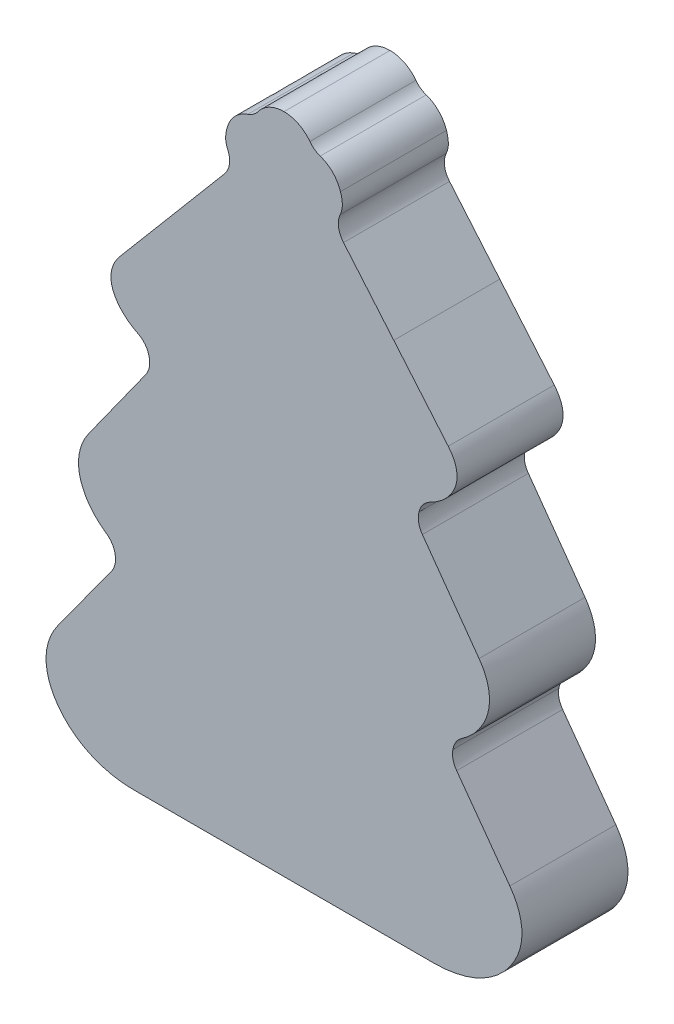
ISO-10303-21;
HEADER;
FILE_DESCRIPTION(('STEP AP214'),'2;1');
FILE_NAME('part.step','',(''),(''),'','','');
FILE_SCHEMA(('AUTOMOTIVE_DESIGN { 1 0 10303 214 1 1 1 1 }'));
ENDSEC;
DATA;
#1=APPLICATION_CONTEXT('core data for automotive mechanical design processes');
#2=APPLICATION_PROTOCOL_DEFINITION('international standard','automotive_design',2000,#1);
#3=PRODUCT_CONTEXT('',#1,'mechanical');
#4=PRODUCT('Part','Part','',(#3));
#5=PRODUCT_RELATED_PRODUCT_CATEGORY('part','',(#4));
#6=PRODUCT_DEFINITION_FORMATION('','',#4);
#7=PRODUCT_DEFINITION_CONTEXT('part definition',#1,'design');
#8=PRODUCT_DEFINITION('design','',#6,#7);
#9=PRODUCT_DEFINITION_SHAPE('','',#8);
#10=(LENGTH_UNIT() NAMED_UNIT(*) SI_UNIT(.MILLI.,.METRE.));
#11=(NAMED_UNIT(*) PLANE_ANGLE_UNIT() SI_UNIT($,.RADIAN.));
#12=(NAMED_UNIT(*) SI_UNIT($,.STERADIAN.) SOLID_ANGLE_UNIT());
#13=UNCERTAINTY_MEASURE_WITH_UNIT(LENGTH_MEASURE(1.E-05),#10,'distance_accuracy_value','');
#14=(GEOMETRIC_REPRESENTATION_CONTEXT(3) GLOBAL_UNCERTAINTY_ASSIGNED_CONTEXT((#13)) GLOBAL_UNIT_ASSIGNED_CONTEXT((#10,
#11,#12)) REPRESENTATION_CONTEXT('',''));
#15=CARTESIAN_POINT('',(0.,0.,0.));
#16=DIRECTION('',(0.,0.,1.));
#17=DIRECTION('',(1.,0.,0.));
#18=AXIS2_PLACEMENT_3D('',#15,#16,#17);
#19=CARTESIAN_POINT('',(364.105599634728,429.743395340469,8.));
#20=CARTESIAN_POINT('',(363.694999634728,430.229595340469,8.));
#21=CARTESIAN_POINT('',(363.602099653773,430.864695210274,8.));
#22=CARTESIAN_POINT('',(363.855999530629,431.448195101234,8.));
#23=B_SPLINE_CURVE_WITH_KNOTS('',3,(#19,#20,#21,#22),.UNSPECIFIED.,.F.,.F.,(4,4),
(0.951219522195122,1.),.UNSPECIFIED.);
#24=DIRECTION('',(0.,0.,-1.));
#25=VECTOR('',#24,1.);
#26=SURFACE_OF_LINEAR_EXTRUSION('',#23,#25);
#27=CARTESIAN_POINT('',(364.105599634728,429.743395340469,0.));
#28=CARTESIAN_POINT('',(363.694999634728,430.229595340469,0.));
#29=CARTESIAN_POINT('',(363.602099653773,430.864695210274,0.));
#30=CARTESIAN_POINT('',(363.855999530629,431.448195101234,0.));
#31=B_SPLINE_CURVE_WITH_KNOTS('',3,(#27,#28,#29,#30),.UNSPECIFIED.,.F.,.F.,(4,4),
(0.951219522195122,1.),.UNSPECIFIED.);
#32=CARTESIAN_POINT('',(364.105599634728,429.743395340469,0.));
#33=VERTEX_POINT('',#32);
#34=CARTESIAN_POINT('',(363.855999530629,431.448195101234,0.));
#35=VERTEX_POINT('',#34);
#36=EDGE_CURVE('E332',#33,#35,#31,.T.);
#37=ORIENTED_EDGE('',*,*,#36,.T.);
#38=DIRECTION('',(0.,0.,-1.));
#39=VECTOR('',#38,1.);
#40=CARTESIAN_POINT('',(363.855999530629,431.448195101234,8.));
#41=LINE('',#40,#39);
#42=CARTESIAN_POINT('',(363.855999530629,431.448195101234,8.));
#43=VERTEX_POINT('',#42);
#44=EDGE_CURVE('E11',#43,#35,#41,.T.);
#45=ORIENTED_EDGE('',*,*,#44,.F.);
#46=CARTESIAN_POINT('',(364.105599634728,429.743395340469,8.));
#47=VERTEX_POINT('',#46);
#48=EDGE_CURVE('E605',#47,#43,#23,.T.);
#49=ORIENTED_EDGE('',*,*,#48,.F.);
#50=DIRECTION('',(0.,0.,-1.));
#51=VECTOR('',#50,1.);
#52=CARTESIAN_POINT('',(364.105599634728,429.743395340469,8.));
#53=LINE('',#52,#51);
#54=EDGE_CURVE('E320',#47,#33,#53,.T.);
#55=ORIENTED_EDGE('',*,*,#54,.T.);
#56=EDGE_LOOP('',(#37,#45,#49,#55));
#57=FACE_BOUND('',#56,.T.);
#58=ADVANCED_FACE('F35',(#57),#26,.F.);
#59=CARTESIAN_POINT('',(363.855999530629,431.448195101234,8.));
#60=CARTESIAN_POINT('',(364.033099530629,431.855295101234,8.));
#61=CARTESIAN_POINT('',(364.100199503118,432.264594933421,8.));
#62=CARTESIAN_POINT('',(363.874899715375,432.958394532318,8.));
#63=B_SPLINE_CURVE_WITH_KNOTS('',3,(#59,#60,#61,#62),.UNSPECIFIED.,.F.,.F.,(4,4),
(0.926829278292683,0.951219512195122),.UNSPECIFIED.);
#64=DIRECTION('',(0.,0.,-1.));
#65=VECTOR('',#64,1.);
#66=SURFACE_OF_LINEAR_EXTRUSION('',#63,#65);
#67=CARTESIAN_POINT('',(363.855999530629,431.448195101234,0.));
#68=CARTESIAN_POINT('',(364.033099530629,431.855295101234,0.));
#69=CARTESIAN_POINT('',(364.100199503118,432.264594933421,0.));
#70=CARTESIAN_POINT('',(363.874899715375,432.958394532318,0.));
#71=B_SPLINE_CURVE_WITH_KNOTS('',3,(#67,#68,#69,#70),.UNSPECIFIED.,.F.,.F.,(4,4),
(0.926829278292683,0.951219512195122),.UNSPECIFIED.);
#72=CARTESIAN_POINT('',(363.874899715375,432.958394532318,0.));
#73=VERTEX_POINT('',#72);
#74=EDGE_CURVE('E337',#35,#73,#71,.T.);
#75=ORIENTED_EDGE('',*,*,#74,.T.);
#76=DIRECTION('',(0.,0.,-1.));
#77=VECTOR('',#76,1.);
#78=CARTESIAN_POINT('',(363.874899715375,432.958394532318,8.));
#79=LINE('',#78,#77);
#80=CARTESIAN_POINT('',(363.874899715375,432.958394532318,8.));
#81=VERTEX_POINT('',#80);
#82=EDGE_CURVE('E44',#81,#73,#79,.T.);
#83=ORIENTED_EDGE('',*,*,#82,.F.);
#84=EDGE_CURVE('E191',#43,#81,#63,.T.);
#85=ORIENTED_EDGE('',*,*,#84,.F.);
#86=ORIENTED_EDGE('',*,*,#44,.T.);
#87=EDGE_LOOP('',(#75,#83,#85,#86));
#88=FACE_BOUND('',#87,.T.);
#89=ADVANCED_FACE('F759',(#88),#66,.F.);
#90=CARTESIAN_POINT('',(363.874899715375,432.958394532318,8.));
#91=CARTESIAN_POINT('',(363.632199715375,433.705994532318,8.));
#92=CARTESIAN_POINT('',(363.062399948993,434.272594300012,8.));
#93=CARTESIAN_POINT('',(362.345900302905,434.517794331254,8.));
#94=B_SPLINE_CURVE_WITH_KNOTS('',3,(#90,#91,#92,#93),.UNSPECIFIED.,.F.,.F.,(4,4),
(0.902439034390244,0.926829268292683),.UNSPECIFIED.);
#95=DIRECTION('',(0.,0.,-1.));
#96=VECTOR('',#95,1.);
#97=SURFACE_OF_LINEAR_EXTRUSION('',#94,#96);
#98=CARTESIAN_POINT('',(363.874899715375,432.958394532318,0.));
#99=CARTESIAN_POINT('',(363.632199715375,433.705994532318,0.));
#100=CARTESIAN_POINT('',(363.062399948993,434.272594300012,0.));
#101=CARTESIAN_POINT('',(362.345900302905,434.517794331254,0.));
#102=B_SPLINE_CURVE_WITH_KNOTS('',3,(#98,#99,#100,#101),.UNSPECIFIED.,.F.,.F.,(4,4),
(0.902439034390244,0.926829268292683),.UNSPECIFIED.);
#103=CARTESIAN_POINT('',(362.345900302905,434.517794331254,0.));
#104=VERTEX_POINT('',#103);
#105=EDGE_CURVE('E344',#73,#104,#102,.T.);
#106=ORIENTED_EDGE('',*,*,#105,.T.);
#107=DIRECTION('',(0.,0.,-1.));
#108=VECTOR('',#107,1.);
#109=CARTESIAN_POINT('',(362.345900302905,434.517794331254,8.));
#110=LINE('',#109,#108);
#111=CARTESIAN_POINT('',(362.345900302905,434.517794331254,8.));
#112=VERTEX_POINT('',#111);
#113=EDGE_CURVE('E705',#112,#104,#110,.T.);
#114=ORIENTED_EDGE('',*,*,#113,.F.);
#115=EDGE_CURVE('E713',#81,#112,#94,.T.);
#116=ORIENTED_EDGE('',*,*,#115,.F.);
#117=ORIENTED_EDGE('',*,*,#82,.T.);
#118=EDGE_LOOP('',(#106,#114,#116,#117));
#119=FACE_BOUND('',#118,.T.);
#120=ADVANCED_FACE('F711',(#119),#97,.F.);
#121=CARTESIAN_POINT('',(362.345900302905,434.517794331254,8.));
#122=CARTESIAN_POINT('',(362.022300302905,434.628494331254,8.));
#123=CARTESIAN_POINT('',(361.773700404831,434.809194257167,8.));
#124=CARTESIAN_POINT('',(361.568500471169,435.08289410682,8.));
#125=B_SPLINE_CURVE_WITH_KNOTS('',3,(#121,#122,#123,#124),.UNSPECIFIED.,.F.,.F.,(4,4),
(0.878048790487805,0.902439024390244),.UNSPECIFIED.);
#126=DIRECTION('',(0.,0.,-1.));
#127=VECTOR('',#126,1.);
#128=SURFACE_OF_LINEAR_EXTRUSION('',#125,#127);
#129=CARTESIAN_POINT('',(362.345900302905,434.517794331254,0.));
#130=CARTESIAN_POINT('',(362.022300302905,434.628494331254,0.));
#131=CARTESIAN_POINT('',(361.773700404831,434.809194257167,0.));
#132=CARTESIAN_POINT('',(361.568500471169,435.08289410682,0.));
#133=B_SPLINE_CURVE_WITH_KNOTS('',3,(#129,#130,#131,#132),.UNSPECIFIED.,.F.,.F.,(4,4),
(0.878048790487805,0.902439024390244),.UNSPECIFIED.);
#134=CARTESIAN_POINT('',(361.568500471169,435.08289410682,0.));
#135=VERTEX_POINT('',#134);
#136=EDGE_CURVE('E351',#104,#135,#133,.T.);
#137=ORIENTED_EDGE('',*,*,#136,.T.);
#138=DIRECTION('',(0.,0.,-1.));
#139=VECTOR('',#138,1.);
#140=CARTESIAN_POINT('',(361.568500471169,435.08289410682,8.));
#141=LINE('',#140,#139);
#142=CARTESIAN_POINT('',(361.568500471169,435.08289410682,8.));
#143=VERTEX_POINT('',#142);
#144=EDGE_CURVE('E702',#143,#135,#141,.T.);
#145=ORIENTED_EDGE('',*,*,#144,.F.);
#146=EDGE_CURVE('E731',#112,#143,#125,.T.);
#147=ORIENTED_EDGE('',*,*,#146,.F.);
#148=ORIENTED_EDGE('',*,*,#113,.T.);
#149=EDGE_LOOP('',(#137,#145,#147,#148));
#150=FACE_BOUND('',#149,.T.);
#151=ADVANCED_FACE('F722',(#150),#128,.F.);
#152=CARTESIAN_POINT('',(361.568500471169,435.08289410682,8.));
#153=CARTESIAN_POINT('',(361.114100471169,435.68849410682,8.));
#154=CARTESIAN_POINT('',(360.399100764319,436.055193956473,8.));
#155=CARTESIAN_POINT('',(359.613201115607,436.05519410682,8.));
#156=B_SPLINE_CURVE_WITH_KNOTS('',3,(#152,#153,#154,#155),.UNSPECIFIED.,.F.,.F.,(4,4),
(0.853658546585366,0.878048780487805),.UNSPECIFIED.);
#157=DIRECTION('',(0.,0.,-1.));
#158=VECTOR('',#157,1.);
#159=SURFACE_OF_LINEAR_EXTRUSION('',#156,#158);
#160=CARTESIAN_POINT('',(361.568500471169,435.08289410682,0.));
#161=CARTESIAN_POINT('',(361.114100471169,435.68849410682,0.));
#162=CARTESIAN_POINT('',(360.399100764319,436.055193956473,0.));
#163=CARTESIAN_POINT('',(359.613201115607,436.05519410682,0.));
#164=B_SPLINE_CURVE_WITH_KNOTS('',3,(#160,#161,#162,#163),.UNSPECIFIED.,.F.,.F.,(4,4),
(0.853658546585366,0.878048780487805),.UNSPECIFIED.);
#165=CARTESIAN_POINT('',(359.613201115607,436.05519410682,0.));
#166=VERTEX_POINT('',#165);
#167=EDGE_CURVE('E358',#135,#166,#164,.T.);
#168=ORIENTED_EDGE('',*,*,#167,.T.);
#169=DIRECTION('',(0.,0.,-1.));
#170=VECTOR('',#169,1.);
#171=CARTESIAN_POINT('',(359.613201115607,436.05519410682,8.));
#172=LINE('',#171,#170);
#173=CARTESIAN_POINT('',(359.613201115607,436.05519410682,8.));
#174=VERTEX_POINT('',#173);
#175=EDGE_CURVE('E699',#174,#166,#172,.T.);
#176=ORIENTED_EDGE('',*,*,#175,.F.);
#177=EDGE_CURVE('E728',#143,#174,#156,.T.);
#178=ORIENTED_EDGE('',*,*,#177,.F.);
#179=ORIENTED_EDGE('',*,*,#144,.T.);
#180=EDGE_LOOP('',(#168,#176,#178,#179));
#181=FACE_BOUND('',#180,.T.);
#182=ADVANCED_FACE('F726',(#181),#159,.F.);
#183=CARTESIAN_POINT('',(359.613201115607,436.05519410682,8.));
#184=CARTESIAN_POINT('',(358.827301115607,436.05519410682,8.));
#185=CARTESIAN_POINT('',(358.112201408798,435.688694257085,8.));
#186=CARTESIAN_POINT('',(357.657701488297,435.082894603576,8.));
#187=B_SPLINE_CURVE_WITH_KNOTS('',3,(#183,#184,#185,#186),.UNSPECIFIED.,.F.,.F.,(4,4),
(0.829268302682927,0.853658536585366),.UNSPECIFIED.);
#188=DIRECTION('',(0.,0.,-1.));
#189=VECTOR('',#188,1.);
#190=SURFACE_OF_LINEAR_EXTRUSION('',#187,#189);
#191=CARTESIAN_POINT('',(359.613201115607,436.05519410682,0.));
#192=CARTESIAN_POINT('',(358.827301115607,436.05519410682,0.));
#193=CARTESIAN_POINT('',(358.112201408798,435.688694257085,0.));
#194=CARTESIAN_POINT('',(357.657701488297,435.082894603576,0.));
#195=B_SPLINE_CURVE_WITH_KNOTS('',3,(#191,#192,#193,#194),.UNSPECIFIED.,.F.,.F.,(4,4),
(0.829268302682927,0.853658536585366),.UNSPECIFIED.);
#196=CARTESIAN_POINT('',(357.657701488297,435.082894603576,0.));
#197=VERTEX_POINT('',#196);
#198=EDGE_CURVE('E365',#166,#197,#195,.T.);
#199=ORIENTED_EDGE('',*,*,#198,.T.);
#200=DIRECTION('',(0.,0.,-1.));
#201=VECTOR('',#200,1.);
#202=CARTESIAN_POINT('',(357.657701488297,435.082894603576,8.));
#203=LINE('',#202,#201);
#204=CARTESIAN_POINT('',(357.657701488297,435.082894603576,8.));
#205=VERTEX_POINT('',#204);
#206=EDGE_CURVE('E696',#205,#197,#203,.T.);
#207=ORIENTED_EDGE('',*,*,#206,.F.);
#208=EDGE_CURVE('E730',#174,#205,#187,.T.);
#209=ORIENTED_EDGE('',*,*,#208,.F.);
#210=ORIENTED_EDGE('',*,*,#175,.T.);
#211=EDGE_LOOP('',(#199,#207,#209,#210));
#212=FACE_BOUND('',#211,.T.);
#213=ADVANCED_FACE('F754',(#212),#190,.F.);
#214=CARTESIAN_POINT('',(357.657701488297,435.082894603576,8.));
#215=CARTESIAN_POINT('',(357.452501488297,434.809194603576,8.));
#216=CARTESIAN_POINT('',(357.203901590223,434.628694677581,8.));
#217=CARTESIAN_POINT('',(356.880101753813,434.51799469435,8.));
#218=B_SPLINE_CURVE_WITH_KNOTS('',3,(#214,#215,#216,#217),.UNSPECIFIED.,.F.,.F.,(4,4),
(0.804878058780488,0.829268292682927),.UNSPECIFIED.);
#219=DIRECTION('',(0.,0.,-1.));
#220=VECTOR('',#219,1.);
#221=SURFACE_OF_LINEAR_EXTRUSION('',#218,#220);
#222=CARTESIAN_POINT('',(357.657701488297,435.082894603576,0.));
#223=CARTESIAN_POINT('',(357.452501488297,434.809194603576,0.));
#224=CARTESIAN_POINT('',(357.203901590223,434.628694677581,0.));
#225=CARTESIAN_POINT('',(356.880101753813,434.51799469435,0.));
#226=B_SPLINE_CURVE_WITH_KNOTS('',3,(#222,#223,#224,#225),.UNSPECIFIED.,.F.,.F.,(4,4),
(0.804878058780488,0.829268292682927),.UNSPECIFIED.);
#227=CARTESIAN_POINT('',(356.880101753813,434.51799469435,0.));
#228=VERTEX_POINT('',#227);
#229=EDGE_CURVE('E372',#197,#228,#226,.T.);
#230=ORIENTED_EDGE('',*,*,#229,.T.);
#231=DIRECTION('',(0.,0.,-1.));
#232=VECTOR('',#231,1.);
#233=CARTESIAN_POINT('',(356.880101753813,434.51799469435,8.));
#234=LINE('',#233,#232);
#235=CARTESIAN_POINT('',(356.880101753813,434.51799469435,8.));
#236=VERTEX_POINT('',#235);
#237=EDGE_CURVE('E693',#236,#228,#234,.T.);
#238=ORIENTED_EDGE('',*,*,#237,.F.);
#239=EDGE_CURVE('E733',#205,#236,#218,.T.);
#240=ORIENTED_EDGE('',*,*,#239,.F.);
#241=ORIENTED_EDGE('',*,*,#206,.T.);
#242=EDGE_LOOP('',(#230,#238,#240,#241));
#243=FACE_BOUND('',#242,.T.);
#244=ADVANCED_FACE('F819',(#243),#221,.F.);
#245=CARTESIAN_POINT('',(356.880101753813,434.51799469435,8.));
#246=CARTESIAN_POINT('',(356.163401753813,434.27289469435,8.));
#247=CARTESIAN_POINT('',(355.593801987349,433.705994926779,8.));
#248=CARTESIAN_POINT('',(355.351101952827,432.958295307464,8.));
#249=B_SPLINE_CURVE_WITH_KNOTS('',3,(#245,#246,#247,#248),.UNSPECIFIED.,.F.,.F.,(4,4),
(0.780487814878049,0.804878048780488),.UNSPECIFIED.);
#250=DIRECTION('',(0.,0.,-1.));
#251=VECTOR('',#250,1.);
#252=SURFACE_OF_LINEAR_EXTRUSION('',#249,#251);
#253=CARTESIAN_POINT('',(356.880101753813,434.51799469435,0.));
#254=CARTESIAN_POINT('',(356.163401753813,434.27289469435,0.));
#255=CARTESIAN_POINT('',(355.593801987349,433.705994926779,0.));
#256=CARTESIAN_POINT('',(355.351101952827,432.958295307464,0.));
#257=B_SPLINE_CURVE_WITH_KNOTS('',3,(#253,#254,#255,#256),.UNSPECIFIED.,.F.,.F.,(4,4),
(0.780487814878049,0.804878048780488),.UNSPECIFIED.);
#258=CARTESIAN_POINT('',(355.351101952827,432.958295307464,0.));
#259=VERTEX_POINT('',#258);
#260=EDGE_CURVE('E379',#228,#259,#257,.T.);
#261=ORIENTED_EDGE('',*,*,#260,.T.);
#262=DIRECTION('',(0.,0.,-1.));
#263=VECTOR('',#262,1.);
#264=CARTESIAN_POINT('',(355.351101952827,432.958295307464,8.));
#265=LINE('',#264,#263);
#266=CARTESIAN_POINT('',(355.351101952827,432.958295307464,8.));
#267=VERTEX_POINT('',#266);
#268=EDGE_CURVE('E690',#267,#259,#265,.T.);
#269=ORIENTED_EDGE('',*,*,#268,.F.);
#270=EDGE_CURVE('E1345',#236,#267,#249,.T.);
#271=ORIENTED_EDGE('',*,*,#270,.F.);
#272=ORIENTED_EDGE('',*,*,#237,.T.);
#273=EDGE_LOOP('',(#261,#269,#271,#272));
#274=FACE_BOUND('',#273,.T.);
#275=ADVANCED_FACE('F828',(#274),#252,.F.);
#276=CARTESIAN_POINT('',(355.351101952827,432.958295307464,8.));
#277=CARTESIAN_POINT('',(355.125801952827,432.264395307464,8.));
#278=CARTESIAN_POINT('',(355.192901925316,431.855095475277,8.));
#279=CARTESIAN_POINT('',(355.370001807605,431.448195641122,8.));
#280=B_SPLINE_CURVE_WITH_KNOTS('',3,(#276,#277,#278,#279),.UNSPECIFIED.,.F.,.F.,(4,4),
(0.75609757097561,0.780487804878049),.UNSPECIFIED.);
#281=DIRECTION('',(0.,0.,-1.));
#282=VECTOR('',#281,1.);
#283=SURFACE_OF_LINEAR_EXTRUSION('',#280,#282);
#284=CARTESIAN_POINT('',(355.351101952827,432.958295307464,0.));
#285=CARTESIAN_POINT('',(355.125801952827,432.264395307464,0.));
#286=CARTESIAN_POINT('',(355.192901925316,431.855095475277,0.));
#287=CARTESIAN_POINT('',(355.370001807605,431.448195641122,0.));
#288=B_SPLINE_CURVE_WITH_KNOTS('',3,(#284,#285,#286,#287),.UNSPECIFIED.,.F.,.F.,(4,4),
(0.75609757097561,0.780487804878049),.UNSPECIFIED.);
#289=CARTESIAN_POINT('',(355.370001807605,431.448195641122,0.));
#290=VERTEX_POINT('',#289);
#291=EDGE_CURVE('E386',#259,#290,#288,.T.);
#292=ORIENTED_EDGE('',*,*,#291,.T.);
#293=DIRECTION('',(0.,0.,-1.));
#294=VECTOR('',#293,1.);
#295=CARTESIAN_POINT('',(355.370001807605,431.448195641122,8.));
#296=LINE('',#295,#294);
#297=CARTESIAN_POINT('',(355.370001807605,431.448195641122,8.));
#298=VERTEX_POINT('',#297);
#299=EDGE_CURVE('E687',#298,#290,#296,.T.);
#300=ORIENTED_EDGE('',*,*,#299,.F.);
#301=EDGE_CURVE('E1339',#267,#298,#280,.T.);
#302=ORIENTED_EDGE('',*,*,#301,.F.);
#303=ORIENTED_EDGE('',*,*,#268,.T.);
#304=EDGE_LOOP('',(#292,#300,#302,#303));
#305=FACE_BOUND('',#304,.T.);
#306=ADVANCED_FACE('F837',(#305),#283,.F.);
#307=CARTESIAN_POINT('',(355.370001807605,431.448195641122,8.));
#308=CARTESIAN_POINT('',(355.624001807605,430.864495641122,8.));
#309=CARTESIAN_POINT('',(355.531001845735,430.229495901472,8.));
#310=CARTESIAN_POINT('',(355.120402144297,429.743296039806,8.));
#311=B_SPLINE_CURVE_WITH_KNOTS('',3,(#307,#308,#309,#310),.UNSPECIFIED.,.F.,.F.,(4,4),
(0.731707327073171,0.75609756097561),.UNSPECIFIED.);
#312=DIRECTION('',(0.,0.,-1.));
#313=VECTOR('',#312,1.);
#314=SURFACE_OF_LINEAR_EXTRUSION('',#311,#313);
#315=CARTESIAN_POINT('',(355.370001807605,431.448195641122,0.));
#316=CARTESIAN_POINT('',(355.624001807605,430.864495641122,0.));
#317=CARTESIAN_POINT('',(355.531001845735,430.229495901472,0.));
#318=CARTESIAN_POINT('',(355.120402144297,429.743296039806,0.));
#319=B_SPLINE_CURVE_WITH_KNOTS('',3,(#315,#316,#317,#318),.UNSPECIFIED.,.F.,.F.,(4,4),
(0.731707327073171,0.75609756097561),.UNSPECIFIED.);
#320=CARTESIAN_POINT('',(355.120402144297,429.743296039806,0.));
#321=VERTEX_POINT('',#320);
#322=EDGE_CURVE('E393',#290,#321,#319,.T.);
#323=ORIENTED_EDGE('',*,*,#322,.T.);
#324=DIRECTION('',(0.,0.,-1.));
#325=VECTOR('',#324,1.);
#326=CARTESIAN_POINT('',(355.120402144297,429.743296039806,8.));
#327=LINE('',#326,#325);
#328=CARTESIAN_POINT('',(355.120402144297,429.743296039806,8.));
#329=VERTEX_POINT('',#328);
#330=EDGE_CURVE('E684',#329,#321,#327,.T.);
#331=ORIENTED_EDGE('',*,*,#330,.F.);
#332=EDGE_CURVE('E1336',#298,#329,#311,.T.);
#333=ORIENTED_EDGE('',*,*,#332,.F.);
#334=ORIENTED_EDGE('',*,*,#299,.T.);
#335=EDGE_LOOP('',(#323,#331,#333,#334));
#336=FACE_BOUND('',#335,.T.);
#337=ADVANCED_FACE('F847',(#336),#314,.F.);
#338=CARTESIAN_POINT('',(355.120402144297,429.743296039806,8.));
#339=DIRECTION('',(0.763981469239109,-0.645238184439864,0.));
#340=DIRECTION('',(0.645238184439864,0.763981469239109,0.));
#341=AXIS2_PLACEMENT_3D('',#338,#339,#340);
#342=PLANE('',#341);
#343=CARTESIAN_POINT('',(355.120402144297,429.743296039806,0.));
#344=CARTESIAN_POINT('',(351.327003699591,425.251797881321,0.));
#345=CARTESIAN_POINT('',(351.327002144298,425.251796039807,0.));
#346=B_SPLINE_CURVE_WITH_KNOTS('',2,(#343,#344,#345),.UNSPECIFIED.,.F.,.F.,(3,3),
(0.707317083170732,0.731707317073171),.UNSPECIFIED.);
#347=CARTESIAN_POINT('',(351.327002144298,425.251796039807,0.));
#348=VERTEX_POINT('',#347);
#349=EDGE_CURVE('E400',#321,#348,#346,.T.);
#350=ORIENTED_EDGE('',*,*,#349,.T.);
#351=DIRECTION('',(0.,0.,-1.));
#352=VECTOR('',#351,1.);
#353=CARTESIAN_POINT('',(351.327002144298,425.251796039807,8.));
#354=LINE('',#353,#352);
#355=CARTESIAN_POINT('',(351.327002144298,425.251796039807,8.));
#356=VERTEX_POINT('',#355);
#357=EDGE_CURVE('E681',#356,#348,#354,.T.);
#358=ORIENTED_EDGE('',*,*,#357,.F.);
#359=CARTESIAN_POINT('',(355.120402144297,429.743296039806,8.));
#360=CARTESIAN_POINT('',(351.327003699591,425.251797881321,8.));
#361=CARTESIAN_POINT('',(351.327002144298,425.251796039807,8.));
#362=B_SPLINE_CURVE_WITH_KNOTS('',2,(#359,#360,#361),.UNSPECIFIED.,.F.,.F.,(3,3),
(0.707317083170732,0.731707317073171),.UNSPECIFIED.);
#363=EDGE_CURVE('E1334',#329,#356,#362,.T.);
#364=ORIENTED_EDGE('',*,*,#363,.F.);
#365=ORIENTED_EDGE('',*,*,#330,.T.);
#366=EDGE_LOOP('',(#350,#358,#364,#365));
#367=FACE_BOUND('',#366,.T.);
#368=ADVANCED_FACE('F857',(#367),#342,.F.);
#369=CARTESIAN_POINT('',(351.327002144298,425.251796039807,8.));
#370=DIRECTION('',(0.763985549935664,-0.645233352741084,0.));
#371=DIRECTION('',(0.645233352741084,0.763985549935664,0.));
#372=AXIS2_PLACEMENT_3D('',#369,#370,#371);
#373=PLANE('',#372);
#374=CARTESIAN_POINT('',(351.327002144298,425.251796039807,0.));
#375=CARTESIAN_POINT('',(347.216603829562,420.384898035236,0.));
#376=CARTESIAN_POINT('',(347.216602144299,420.384896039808,0.));
#377=B_SPLINE_CURVE_WITH_KNOTS('',2,(#374,#375,#376),.UNSPECIFIED.,.F.,.F.,(3,3),
(0.682926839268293,0.707317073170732),.UNSPECIFIED.);
#378=CARTESIAN_POINT('',(347.216602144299,420.384896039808,0.));
#379=VERTEX_POINT('',#378);
#380=EDGE_CURVE('E407',#348,#379,#377,.T.);
#381=ORIENTED_EDGE('',*,*,#380,.T.);
#382=DIRECTION('',(0.,0.,-1.));
#383=VECTOR('',#382,1.);
#384=CARTESIAN_POINT('',(347.216602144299,420.384896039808,8.));
#385=LINE('',#384,#383);
#386=CARTESIAN_POINT('',(347.216602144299,420.384896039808,8.));
#387=VERTEX_POINT('',#386);
#388=EDGE_CURVE('E678',#387,#379,#385,.T.);
#389=ORIENTED_EDGE('',*,*,#388,.F.);
#390=CARTESIAN_POINT('',(351.327002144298,425.251796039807,8.));
#391=CARTESIAN_POINT('',(347.216603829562,420.384898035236,8.));
#392=CARTESIAN_POINT('',(347.216602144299,420.384896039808,8.));
#393=B_SPLINE_CURVE_WITH_KNOTS('',2,(#390,#391,#392),.UNSPECIFIED.,.F.,.F.,(3,3),
(0.682926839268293,0.707317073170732),.UNSPECIFIED.);
#394=EDGE_CURVE('E1327',#356,#387,#393,.T.);
#395=ORIENTED_EDGE('',*,*,#394,.F.);
#396=ORIENTED_EDGE('',*,*,#357,.T.);
#397=EDGE_LOOP('',(#381,#389,#395,#396));
#398=FACE_BOUND('',#397,.T.);
#399=ADVANCED_FACE('F867',(#398),#373,.F.);
#400=CARTESIAN_POINT('',(347.216602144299,420.384896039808,8.));
#401=CARTESIAN_POINT('',(346.331402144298,419.336796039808,8.));
#402=CARTESIAN_POINT('',(346.331602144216,418.136996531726,8.));
#403=CARTESIAN_POINT('',(347.216601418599,417.08889689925,8.));
#404=B_SPLINE_CURVE_WITH_KNOTS('',3,(#400,#401,#402,#403),.UNSPECIFIED.,.F.,.F.,(4,4),
(0.658536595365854,0.682926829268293),.UNSPECIFIED.);
#405=DIRECTION('',(0.,0.,-1.));
#406=VECTOR('',#405,1.);
#407=SURFACE_OF_LINEAR_EXTRUSION('',#404,#406);
#408=CARTESIAN_POINT('',(347.216602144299,420.384896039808,0.));
#409=CARTESIAN_POINT('',(346.331402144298,419.336796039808,0.));
#410=CARTESIAN_POINT('',(346.331602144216,418.136996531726,0.));
#411=CARTESIAN_POINT('',(347.216601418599,417.08889689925,0.));
#412=B_SPLINE_CURVE_WITH_KNOTS('',3,(#408,#409,#410,#411),.UNSPECIFIED.,.F.,.F.,(4,4),
(0.658536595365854,0.682926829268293),.UNSPECIFIED.);
#413=CARTESIAN_POINT('',(347.216601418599,417.08889689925,0.));
#414=VERTEX_POINT('',#413);
#415=EDGE_CURVE('E414',#379,#414,#412,.T.);
#416=ORIENTED_EDGE('',*,*,#415,.T.);
#417=DIRECTION('',(0.,0.,-1.));
#418=VECTOR('',#417,1.);
#419=CARTESIAN_POINT('',(347.216601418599,417.08889689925,8.));
#420=LINE('',#419,#418);
#421=CARTESIAN_POINT('',(347.216601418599,417.08889689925,8.));
#422=VERTEX_POINT('',#421);
#423=EDGE_CURVE('E675',#422,#414,#420,.T.);
#424=ORIENTED_EDGE('',*,*,#423,.F.);
#425=EDGE_CURVE('E1324',#387,#422,#404,.T.);
#426=ORIENTED_EDGE('',*,*,#425,.F.);
#427=ORIENTED_EDGE('',*,*,#388,.T.);
#428=EDGE_LOOP('',(#416,#424,#426,#427));
#429=FACE_BOUND('',#428,.T.);
#430=ADVANCED_FACE('F877',(#429),#407,.F.);
#431=CARTESIAN_POINT('',(347.216601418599,417.08889689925,8.));
#432=CARTESIAN_POINT('',(347.572701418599,416.66739689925,8.));
#433=CARTESIAN_POINT('',(348.03160123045,416.317997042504,8.));
#434=CARTESIAN_POINT('',(348.568000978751,416.051397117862,8.));
#435=B_SPLINE_CURVE_WITH_KNOTS('',3,(#431,#432,#433,#434),.UNSPECIFIED.,.F.,.F.,(4,4),
(0.634146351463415,0.658536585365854),.UNSPECIFIED.);
#436=DIRECTION('',(0.,0.,-1.));
#437=VECTOR('',#436,1.);
#438=SURFACE_OF_LINEAR_EXTRUSION('',#435,#437);
#439=CARTESIAN_POINT('',(347.216601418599,417.08889689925,0.));
#440=CARTESIAN_POINT('',(347.572701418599,416.66739689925,0.));
#441=CARTESIAN_POINT('',(348.03160123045,416.317997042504,0.));
#442=CARTESIAN_POINT('',(348.568000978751,416.051397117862,0.));
#443=B_SPLINE_CURVE_WITH_KNOTS('',3,(#439,#440,#441,#442),.UNSPECIFIED.,.F.,.F.,(4,4),
(0.634146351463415,0.658536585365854),.UNSPECIFIED.);
#444=CARTESIAN_POINT('',(348.568000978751,416.051397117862,0.));
#445=VERTEX_POINT('',#444);
#446=EDGE_CURVE('E421',#414,#445,#443,.T.);
#447=ORIENTED_EDGE('',*,*,#446,.T.);
#448=DIRECTION('',(0.,0.,-1.));
#449=VECTOR('',#448,1.);
#450=CARTESIAN_POINT('',(348.568000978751,416.051397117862,8.));
#451=LINE('',#450,#449);
#452=CARTESIAN_POINT('',(348.568000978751,416.051397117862,8.));
#453=VERTEX_POINT('',#452);
#454=EDGE_CURVE('E672',#453,#445,#451,.T.);
#455=ORIENTED_EDGE('',*,*,#454,.F.);
#456=EDGE_CURVE('E1322',#422,#453,#435,.T.);
#457=ORIENTED_EDGE('',*,*,#456,.F.);
#458=ORIENTED_EDGE('',*,*,#423,.T.);
#459=EDGE_LOOP('',(#447,#455,#457,#458));
#460=FACE_BOUND('',#459,.T.);
#461=ADVANCED_FACE('F887',(#460),#438,.F.);
#462=CARTESIAN_POINT('',(348.568000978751,416.051397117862,8.));
#463=CARTESIAN_POINT('',(349.011700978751,415.830897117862,8.));
#464=CARTESIAN_POINT('',(349.305900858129,415.464697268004,8.));
#465=CARTESIAN_POINT('',(349.425600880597,414.983897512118,8.));
#466=B_SPLINE_CURVE_WITH_KNOTS('',3,(#462,#463,#464,#465),.UNSPECIFIED.,.F.,.F.,(4,4),
(0.609756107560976,0.634146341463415),.UNSPECIFIED.);
#467=DIRECTION('',(0.,0.,-1.));
#468=VECTOR('',#467,1.);
#469=SURFACE_OF_LINEAR_EXTRUSION('',#466,#468);
#470=CARTESIAN_POINT('',(348.568000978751,416.051397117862,0.));
#471=CARTESIAN_POINT('',(349.011700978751,415.830897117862,0.));
#472=CARTESIAN_POINT('',(349.305900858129,415.464697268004,0.));
#473=CARTESIAN_POINT('',(349.425600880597,414.983897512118,0.));
#474=B_SPLINE_CURVE_WITH_KNOTS('',3,(#470,#471,#472,#473),.UNSPECIFIED.,.F.,.F.,(4,4),
(0.609756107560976,0.634146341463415),.UNSPECIFIED.);
#475=CARTESIAN_POINT('',(349.425600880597,414.983897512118,0.));
#476=VERTEX_POINT('',#475);
#477=EDGE_CURVE('E428',#445,#476,#474,.T.);
#478=ORIENTED_EDGE('',*,*,#477,.T.);
#479=DIRECTION('',(0.,0.,-1.));
#480=VECTOR('',#479,1.);
#481=CARTESIAN_POINT('',(349.425600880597,414.983897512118,8.));
#482=LINE('',#481,#480);
#483=CARTESIAN_POINT('',(349.425600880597,414.983897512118,8.));
#484=VERTEX_POINT('',#483);
#485=EDGE_CURVE('E669',#484,#476,#482,.T.);
#486=ORIENTED_EDGE('',*,*,#485,.F.);
#487=EDGE_CURVE('E1315',#453,#484,#466,.T.);
#488=ORIENTED_EDGE('',*,*,#487,.F.);
#489=ORIENTED_EDGE('',*,*,#454,.T.);
#490=EDGE_LOOP('',(#478,#486,#488,#489));
#491=FACE_BOUND('',#490,.T.);
#492=ADVANCED_FACE('F897',(#491),#469,.F.);
#493=CARTESIAN_POINT('',(349.425600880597,414.983897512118,8.));
#494=CARTESIAN_POINT('',(349.545300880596,414.503097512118,8.));
#495=CARTESIAN_POINT('',(349.457100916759,414.041597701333,8.));
#496=CARTESIAN_POINT('',(349.168601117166,413.638897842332,8.));
#497=B_SPLINE_CURVE_WITH_KNOTS('',3,(#493,#494,#495,#496),.UNSPECIFIED.,.F.,.F.,(4,4),
(0.585365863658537,0.609756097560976),.UNSPECIFIED.);
#498=DIRECTION('',(0.,0.,-1.));
#499=VECTOR('',#498,1.);
#500=SURFACE_OF_LINEAR_EXTRUSION('',#497,#499);
#501=CARTESIAN_POINT('',(349.425600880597,414.983897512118,0.));
#502=CARTESIAN_POINT('',(349.545300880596,414.503097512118,0.));
#503=CARTESIAN_POINT('',(349.457100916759,414.041597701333,0.));
#504=CARTESIAN_POINT('',(349.168601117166,413.638897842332,0.));
#505=B_SPLINE_CURVE_WITH_KNOTS('',3,(#501,#502,#503,#504),.UNSPECIFIED.,.F.,.F.,(4,4),
(0.585365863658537,0.609756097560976),.UNSPECIFIED.);
#506=CARTESIAN_POINT('',(349.168601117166,413.638897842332,0.));
#507=VERTEX_POINT('',#506);
#508=EDGE_CURVE('E435',#476,#507,#505,.T.);
#509=ORIENTED_EDGE('',*,*,#508,.T.);
#510=DIRECTION('',(0.,0.,-1.));
#511=VECTOR('',#510,1.);
#512=CARTESIAN_POINT('',(349.168601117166,413.638897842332,8.));
#513=LINE('',#512,#511);
#514=CARTESIAN_POINT('',(349.168601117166,413.638897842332,8.));
#515=VERTEX_POINT('',#514);
#516=EDGE_CURVE('E666',#515,#507,#513,.T.);
#517=ORIENTED_EDGE('',*,*,#516,.F.);
#518=EDGE_CURVE('E1312',#484,#515,#497,.T.);
#519=ORIENTED_EDGE('',*,*,#518,.F.);
#520=ORIENTED_EDGE('',*,*,#485,.T.);
#521=EDGE_LOOP('',(#509,#517,#519,#520));
#522=FACE_BOUND('',#521,.T.);
#523=ADVANCED_FACE('F907',(#522),#500,.F.);
#524=CARTESIAN_POINT('',(349.168601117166,413.638897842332,8.));
#525=DIRECTION('',(0.812931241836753,-0.582359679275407,0.));
#526=DIRECTION('',(0.582359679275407,0.812931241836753,0.));
#527=AXIS2_PLACEMENT_3D('',#524,#525,#526);
#528=PLANE('',#527);
#529=CARTESIAN_POINT('',(349.168601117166,413.638897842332,0.));
#530=CARTESIAN_POINT('',(344.892302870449,407.669500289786,0.));
#531=CARTESIAN_POINT('',(344.892301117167,407.669497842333,0.));
#532=B_SPLINE_CURVE_WITH_KNOTS('',2,(#529,#530,#531),.UNSPECIFIED.,.F.,.F.,(3,3),
(0.560975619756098,0.585365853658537),.UNSPECIFIED.);
#533=CARTESIAN_POINT('',(344.892301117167,407.669497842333,0.));
#534=VERTEX_POINT('',#533);
#535=EDGE_CURVE('E442',#507,#534,#532,.T.);
#536=ORIENTED_EDGE('',*,*,#535,.T.);
#537=DIRECTION('',(0.,0.,-1.));
#538=VECTOR('',#537,1.);
#539=CARTESIAN_POINT('',(344.892301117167,407.669497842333,8.));
#540=LINE('',#539,#538);
#541=CARTESIAN_POINT('',(344.892301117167,407.669497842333,8.));
#542=VERTEX_POINT('',#541);
#543=EDGE_CURVE('E663',#542,#534,#540,.T.);
#544=ORIENTED_EDGE('',*,*,#543,.F.);
#545=CARTESIAN_POINT('',(349.168601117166,413.638897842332,8.));
#546=CARTESIAN_POINT('',(344.892302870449,407.669500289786,8.));
#547=CARTESIAN_POINT('',(344.892301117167,407.669497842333,8.));
#548=B_SPLINE_CURVE_WITH_KNOTS('',2,(#545,#546,#547),.UNSPECIFIED.,.F.,.F.,(3,3),
(0.560975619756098,0.585365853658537),.UNSPECIFIED.);
#549=EDGE_CURVE('E1310',#515,#542,#548,.T.);
#550=ORIENTED_EDGE('',*,*,#549,.F.);
#551=ORIENTED_EDGE('',*,*,#516,.T.);
#552=EDGE_LOOP('',(#536,#544,#550,#551));
#553=FACE_BOUND('',#552,.T.);
#554=ADVANCED_FACE('F917',(#553),#528,.F.);
#555=CARTESIAN_POINT('',(344.892301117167,407.669497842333,8.));
#556=CARTESIAN_POINT('',(343.841101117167,406.202297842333,8.));
#557=CARTESIAN_POINT('',(343.841301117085,404.52259853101,8.));
#558=CARTESIAN_POINT('',(344.892300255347,403.055199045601,8.));
#559=B_SPLINE_CURVE_WITH_KNOTS('',3,(#555,#556,#557,#558),.UNSPECIFIED.,.F.,.F.,(4,4),
(0.536585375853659,0.560975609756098),.UNSPECIFIED.);
#560=DIRECTION('',(0.,0.,-1.));
#561=VECTOR('',#560,1.);
#562=SURFACE_OF_LINEAR_EXTRUSION('',#559,#561);
#563=CARTESIAN_POINT('',(344.892301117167,407.669497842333,0.));
#564=CARTESIAN_POINT('',(343.841101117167,406.202297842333,0.));
#565=CARTESIAN_POINT('',(343.841301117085,404.52259853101,0.));
#566=CARTESIAN_POINT('',(344.892300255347,403.055199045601,0.));
#567=B_SPLINE_CURVE_WITH_KNOTS('',3,(#563,#564,#565,#566),.UNSPECIFIED.,.F.,.F.,(4,4),
(0.536585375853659,0.560975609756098),.UNSPECIFIED.);
#568=CARTESIAN_POINT('',(344.892300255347,403.055199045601,0.));
#569=VERTEX_POINT('',#568);
#570=EDGE_CURVE('E449',#534,#569,#567,.T.);
#571=ORIENTED_EDGE('',*,*,#570,.T.);
#572=DIRECTION('',(0.,0.,-1.));
#573=VECTOR('',#572,1.);
#574=CARTESIAN_POINT('',(344.892300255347,403.055199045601,8.));
#575=LINE('',#574,#573);
#576=CARTESIAN_POINT('',(344.892300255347,403.055199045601,8.));
#577=VERTEX_POINT('',#576);
#578=EDGE_CURVE('E660',#577,#569,#575,.T.);
#579=ORIENTED_EDGE('',*,*,#578,.F.);
#580=EDGE_CURVE('E1303',#542,#577,#559,.T.);
#581=ORIENTED_EDGE('',*,*,#580,.F.);
#582=ORIENTED_EDGE('',*,*,#543,.T.);
#583=EDGE_LOOP('',(#571,#579,#581,#582));
#584=FACE_BOUND('',#583,.T.);
#585=ADVANCED_FACE('F927',(#584),#562,.F.);
#586=CARTESIAN_POINT('',(344.892300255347,403.055199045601,8.));
#587=CARTESIAN_POINT('',(345.243200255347,402.565499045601,8.));
#588=CARTESIAN_POINT('',(345.678200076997,402.145399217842,8.));
#589=CARTESIAN_POINT('',(346.179899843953,401.803399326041,8.));
#590=B_SPLINE_CURVE_WITH_KNOTS('',3,(#586,#587,#588,#589),.UNSPECIFIED.,.F.,.F.,(4,4),
(0.51219513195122,0.536585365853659),.UNSPECIFIED.);
#591=DIRECTION('',(0.,0.,-1.));
#592=VECTOR('',#591,1.);
#593=SURFACE_OF_LINEAR_EXTRUSION('',#590,#592);
#594=CARTESIAN_POINT('',(344.892300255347,403.055199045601,0.));
#595=CARTESIAN_POINT('',(345.243200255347,402.565499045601,0.));
#596=CARTESIAN_POINT('',(345.678200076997,402.145399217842,0.));
#597=CARTESIAN_POINT('',(346.179899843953,401.803399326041,0.));
#598=B_SPLINE_CURVE_WITH_KNOTS('',3,(#594,#595,#596,#597),.UNSPECIFIED.,.F.,.F.,(4,4),
(0.51219513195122,0.536585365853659),.UNSPECIFIED.);
#599=CARTESIAN_POINT('',(346.179899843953,401.803399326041,0.));
#600=VERTEX_POINT('',#599);
#601=EDGE_CURVE('E456',#569,#600,#598,.T.);
#602=ORIENTED_EDGE('',*,*,#601,.T.);
#603=DIRECTION('',(0.,0.,-1.));
#604=VECTOR('',#603,1.);
#605=CARTESIAN_POINT('',(346.179899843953,401.803399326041,8.));
#606=LINE('',#605,#604);
#607=CARTESIAN_POINT('',(346.179899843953,401.803399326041,8.));
#608=VERTEX_POINT('',#607);
#609=EDGE_CURVE('E657',#608,#600,#606,.T.);
#610=ORIENTED_EDGE('',*,*,#609,.F.);
#611=EDGE_CURVE('E1300',#577,#608,#590,.T.);
#612=ORIENTED_EDGE('',*,*,#611,.F.);
#613=ORIENTED_EDGE('',*,*,#578,.T.);
#614=EDGE_LOOP('',(#602,#610,#612,#613));
#615=FACE_BOUND('',#614,.T.);
#616=ADVANCED_FACE('F937',(#615),#593,.F.);
#617=CARTESIAN_POINT('',(346.179899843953,401.803399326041,8.));
#618=CARTESIAN_POINT('',(346.558399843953,401.545499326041,8.));
#619=CARTESIAN_POINT('',(346.790199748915,401.1855994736,8.));
#620=CARTESIAN_POINT('',(346.868899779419,400.734399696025,8.));
#621=B_SPLINE_CURVE_WITH_KNOTS('',3,(#617,#618,#619,#620),.UNSPECIFIED.,.F.,.F.,(4,4),
(0.48780488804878,0.51219512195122),.UNSPECIFIED.);
#622=DIRECTION('',(0.,0.,-1.));
#623=VECTOR('',#622,1.);
#624=SURFACE_OF_LINEAR_EXTRUSION('',#621,#623);
#625=CARTESIAN_POINT('',(346.179899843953,401.803399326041,0.));
#626=CARTESIAN_POINT('',(346.558399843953,401.545499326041,0.));
#627=CARTESIAN_POINT('',(346.790199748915,401.1855994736,0.));
#628=CARTESIAN_POINT('',(346.868899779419,400.734399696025,0.));
#629=B_SPLINE_CURVE_WITH_KNOTS('',3,(#625,#626,#627,#628),.UNSPECIFIED.,.F.,.F.,(4,4),
(0.48780488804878,0.51219512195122),.UNSPECIFIED.);
#630=CARTESIAN_POINT('',(346.868899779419,400.734399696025,0.));
#631=VERTEX_POINT('',#630);
#632=EDGE_CURVE('E463',#600,#631,#629,.T.);
#633=ORIENTED_EDGE('',*,*,#632,.T.);
#634=DIRECTION('',(0.,0.,-1.));
#635=VECTOR('',#634,1.);
#636=CARTESIAN_POINT('',(346.868899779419,400.734399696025,8.));
#637=LINE('',#636,#635);
#638=CARTESIAN_POINT('',(346.868899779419,400.734399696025,8.));
#639=VERTEX_POINT('',#638);
#640=EDGE_CURVE('E654',#639,#631,#637,.T.);
#641=ORIENTED_EDGE('',*,*,#640,.F.);
#642=EDGE_CURVE('E1298',#608,#639,#621,.T.);
#643=ORIENTED_EDGE('',*,*,#642,.F.);
#644=ORIENTED_EDGE('',*,*,#609,.T.);
#645=EDGE_LOOP('',(#633,#641,#643,#644));
#646=FACE_BOUND('',#645,.T.);
#647=ADVANCED_FACE('F947',(#646),#624,.F.);
#648=CARTESIAN_POINT('',(346.868899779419,400.734399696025,8.));
#649=CARTESIAN_POINT('',(346.947399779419,400.283199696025,8.));
#650=CARTESIAN_POINT('',(346.850699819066,399.866199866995,8.));
#651=CARTESIAN_POINT('',(346.581699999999,399.495499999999,8.));
#652=B_SPLINE_CURVE_WITH_KNOTS('',3,(#648,#649,#650,#651),.UNSPECIFIED.,.F.,.F.,(4,4),
(0.463414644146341,0.48780487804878),.UNSPECIFIED.);
#653=DIRECTION('',(0.,0.,-1.));
#654=VECTOR('',#653,1.);
#655=SURFACE_OF_LINEAR_EXTRUSION('',#652,#654);
#656=CARTESIAN_POINT('',(346.868899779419,400.734399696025,0.));
#657=CARTESIAN_POINT('',(346.947399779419,400.283199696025,0.));
#658=CARTESIAN_POINT('',(346.850699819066,399.866199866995,0.));
#659=CARTESIAN_POINT('',(346.581699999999,399.495499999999,0.));
#660=B_SPLINE_CURVE_WITH_KNOTS('',3,(#656,#657,#658,#659),.UNSPECIFIED.,.F.,.F.,(4,4),
(0.463414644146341,0.48780487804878),.UNSPECIFIED.);
#661=CARTESIAN_POINT('',(346.5817,399.4955,0.));
#662=VERTEX_POINT('',#661);
#663=EDGE_CURVE('E470',#631,#662,#660,.T.);
#664=ORIENTED_EDGE('',*,*,#663,.T.);
#665=DIRECTION('',(0.,0.,-1.));
#666=VECTOR('',#665,1.);
#667=CARTESIAN_POINT('',(346.5817,399.4955,8.));
#668=LINE('',#667,#666);
#669=CARTESIAN_POINT('',(346.5817,399.4955,8.));
#670=VERTEX_POINT('',#669);
#671=EDGE_CURVE('E651',#670,#662,#668,.T.);
#672=ORIENTED_EDGE('',*,*,#671,.F.);
#673=EDGE_CURVE('E1291',#639,#670,#652,.T.);
#674=ORIENTED_EDGE('',*,*,#673,.F.);
#675=ORIENTED_EDGE('',*,*,#640,.T.);
#676=EDGE_LOOP('',(#664,#672,#674,#675));
#677=FACE_BOUND('',#676,.T.);
#678=ADVANCED_FACE('F957',(#677),#655,.F.);
#679=CARTESIAN_POINT('',(346.5817,399.4955,8.));
#680=DIRECTION('',(0.809298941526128,-0.587396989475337,0.));
#681=DIRECTION('',(0.587396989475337,0.809298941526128,0.));
#682=AXIS2_PLACEMENT_3D('',#679,#680,#681);
#683=PLANE('',#682);
#684=CARTESIAN_POINT('',(346.5817,399.4955,0.));
#685=CARTESIAN_POINT('',(342.567901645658,393.965402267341,0.));
#686=CARTESIAN_POINT('',(342.567900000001,393.965400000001,0.));
#687=B_SPLINE_CURVE_WITH_KNOTS('',2,(#684,#685,#686),.UNSPECIFIED.,.F.,.F.,(3,3),
(0.439024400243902,0.463414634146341),.UNSPECIFIED.);
#688=CARTESIAN_POINT('',(342.5679,393.9654,0.));
#689=VERTEX_POINT('',#688);
#690=EDGE_CURVE('E477',#662,#689,#687,.T.);
#691=ORIENTED_EDGE('',*,*,#690,.T.);
#692=DIRECTION('',(0.,0.,-1.));
#693=VECTOR('',#692,1.);
#694=CARTESIAN_POINT('',(342.5679,393.9654,8.));
#695=LINE('',#694,#693);
#696=CARTESIAN_POINT('',(342.5679,393.9654,8.));
#697=VERTEX_POINT('',#696);
#698=EDGE_CURVE('E648',#697,#689,#695,.T.);
#699=ORIENTED_EDGE('',*,*,#698,.F.);
#700=CARTESIAN_POINT('',(346.5817,399.4955,8.));
#701=CARTESIAN_POINT('',(342.567901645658,393.965402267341,8.));
#702=CARTESIAN_POINT('',(342.567900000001,393.965400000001,8.));
#703=B_SPLINE_CURVE_WITH_KNOTS('',2,(#700,#701,#702),.UNSPECIFIED.,.F.,.F.,(3,3),
(0.439024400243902,0.463414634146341),.UNSPECIFIED.);
#704=EDGE_CURVE('E1288',#670,#697,#703,.T.);
#705=ORIENTED_EDGE('',*,*,#704,.F.);
#706=ORIENTED_EDGE('',*,*,#671,.T.);
#707=EDGE_LOOP('',(#691,#699,#705,#706));
#708=FACE_BOUND('',#707,.T.);
#709=ADVANCED_FACE('F967',(#708),#683,.F.);
#710=CARTESIAN_POINT('',(342.5679,393.9654,8.));
#711=CARTESIAN_POINT('',(341.3507,392.2886,8.));
#712=CARTESIAN_POINT('',(341.3507,390.369000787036,8.));
#713=CARTESIAN_POINT('',(342.567899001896,388.691901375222,8.));
#714=B_SPLINE_CURVE_WITH_KNOTS('',3,(#710,#711,#712,#713),.UNSPECIFIED.,.F.,.F.,(4,4),
(0.414634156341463,0.439024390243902),.UNSPECIFIED.);
#715=DIRECTION('',(0.,0.,-1.));
#716=VECTOR('',#715,1.);
#717=SURFACE_OF_LINEAR_EXTRUSION('',#714,#716);
#718=CARTESIAN_POINT('',(342.5679,393.9654,0.));
#719=CARTESIAN_POINT('',(341.3507,392.2886,0.));
#720=CARTESIAN_POINT('',(341.3507,390.369000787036,0.));
#721=CARTESIAN_POINT('',(342.567899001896,388.691901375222,0.));
#722=B_SPLINE_CURVE_WITH_KNOTS('',3,(#718,#719,#720,#721),.UNSPECIFIED.,.F.,.F.,(4,4),
(0.414634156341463,0.439024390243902),.UNSPECIFIED.);
#723=CARTESIAN_POINT('',(342.567899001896,388.691901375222,0.));
#724=VERTEX_POINT('',#723);
#725=EDGE_CURVE('E484',#689,#724,#722,.T.);
#726=ORIENTED_EDGE('',*,*,#725,.T.);
#727=DIRECTION('',(0.,0.,-1.));
#728=VECTOR('',#727,1.);
#729=CARTESIAN_POINT('',(342.567899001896,388.691901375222,8.));
#730=LINE('',#729,#728);
#731=CARTESIAN_POINT('',(342.567899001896,388.691901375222,8.));
#732=VERTEX_POINT('',#731);
#733=EDGE_CURVE('E645',#732,#724,#730,.T.);
#734=ORIENTED_EDGE('',*,*,#733,.F.);
#735=EDGE_CURVE('E1286',#697,#732,#714,.T.);
#736=ORIENTED_EDGE('',*,*,#735,.F.);
#737=ORIENTED_EDGE('',*,*,#698,.T.);
#738=EDGE_LOOP('',(#726,#734,#736,#737));
#739=FACE_BOUND('',#738,.T.);
#740=ADVANCED_FACE('F977',(#739),#717,.F.);
#741=CARTESIAN_POINT('',(342.567899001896,388.691901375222,8.));
#742=CARTESIAN_POINT('',(343.785099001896,387.014801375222,8.));
#743=CARTESIAN_POINT('',(345.874798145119,386.055201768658,8.));
#744=CARTESIAN_POINT('',(348.309297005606,386.055201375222,8.));
#745=B_SPLINE_CURVE_WITH_KNOTS('',3,(#741,#742,#743,#744),.UNSPECIFIED.,.F.,.F.,(4,4),
(0.390243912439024,0.414634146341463),.UNSPECIFIED.);
#746=DIRECTION('',(0.,0.,-1.));
#747=VECTOR('',#746,1.);
#748=SURFACE_OF_LINEAR_EXTRUSION('',#745,#747);
#749=CARTESIAN_POINT('',(342.567899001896,388.691901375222,0.));
#750=CARTESIAN_POINT('',(343.785099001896,387.014801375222,0.));
#751=CARTESIAN_POINT('',(345.874798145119,386.055201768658,0.));
#752=CARTESIAN_POINT('',(348.309297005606,386.055201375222,0.));
#753=B_SPLINE_CURVE_WITH_KNOTS('',3,(#749,#750,#751,#752),.UNSPECIFIED.,.F.,.F.,(4,4),
(0.390243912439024,0.414634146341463),.UNSPECIFIED.);
#754=CARTESIAN_POINT('',(348.309297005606,386.055201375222,0.));
#755=VERTEX_POINT('',#754);
#756=EDGE_CURVE('E491',#724,#755,#753,.T.);
#757=ORIENTED_EDGE('',*,*,#756,.T.);
#758=DIRECTION('',(0.,0.,-1.));
#759=VECTOR('',#758,1.);
#760=CARTESIAN_POINT('',(348.309297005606,386.055201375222,8.));
#761=LINE('',#760,#759);
#762=CARTESIAN_POINT('',(348.309297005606,386.055201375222,8.));
#763=VERTEX_POINT('',#762);
#764=EDGE_CURVE('E642',#763,#755,#761,.T.);
#765=ORIENTED_EDGE('',*,*,#764,.F.);
#766=EDGE_CURVE('E1279',#732,#763,#745,.T.);
#767=ORIENTED_EDGE('',*,*,#766,.F.);
#768=ORIENTED_EDGE('',*,*,#733,.T.);
#769=EDGE_LOOP('',(#757,#765,#767,#768));
#770=FACE_BOUND('',#769,.T.);
#771=ADVANCED_FACE('F987',(#770),#748,.F.);
#772=CARTESIAN_POINT('',(359.612997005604,386.055201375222,8.));
#773=DIRECTION('',(0.,1.,0.));
#774=DIRECTION('',(-1.,0.,0.));
#775=AXIS2_PLACEMENT_3D('',#772,#773,#774);
#776=PLANE('',#775);
#777=CARTESIAN_POINT('',(359.612997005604,386.055201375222,0.));
#778=CARTESIAN_POINT('',(370.916692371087,386.055201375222,0.));
#779=CARTESIAN_POINT('',(370.916697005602,386.055201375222,0.));
#780=B_SPLINE_CURVE_WITH_KNOTS('',2,(#777,#778,#779),.UNSPECIFIED.,.F.,.F.,(3,3),
(0.341463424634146,0.365853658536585),.UNSPECIFIED.);
#781=CARTESIAN_POINT('',(359.612997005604,386.055201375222,0.));
#782=VERTEX_POINT('',#781);
#783=CARTESIAN_POINT('',(370.916697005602,386.055201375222,0.));
#784=VERTEX_POINT('',#783);
#785=EDGE_CURVE('E505',#782,#784,#780,.T.);
#786=ORIENTED_EDGE('',*,*,#785,.T.);
#787=DIRECTION('',(0.,0.,-1.));
#788=VECTOR('',#787,1.);
#789=CARTESIAN_POINT('',(370.916697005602,386.055201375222,8.));
#790=LINE('',#789,#788);
#791=CARTESIAN_POINT('',(370.916697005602,386.055201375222,8.));
#792=VERTEX_POINT('',#791);
#793=EDGE_CURVE('E639',#792,#784,#790,.T.);
#794=ORIENTED_EDGE('',*,*,#793,.F.);
#795=CARTESIAN_POINT('',(359.612997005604,386.055201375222,8.));
#796=CARTESIAN_POINT('',(370.916692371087,386.055201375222,8.));
#797=CARTESIAN_POINT('',(370.916697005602,386.055201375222,8.));
#798=B_SPLINE_CURVE_WITH_KNOTS('',2,(#795,#796,#797),.UNSPECIFIED.,.F.,.F.,(3,3),
(0.341463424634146,0.365853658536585),.UNSPECIFIED.);
#799=CARTESIAN_POINT('',(359.612997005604,386.055201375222,8.));
#800=VERTEX_POINT('',#799);
#801=EDGE_CURVE('E1463',#800,#792,#798,.T.);
#802=ORIENTED_EDGE('',*,*,#801,.F.);
#803=CARTESIAN_POINT('',(348.309297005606,386.055201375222,8.));
#804=CARTESIAN_POINT('',(359.612992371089,386.055201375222,8.));
#805=CARTESIAN_POINT('',(359.612997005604,386.055201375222,8.));
#806=B_SPLINE_CURVE_WITH_KNOTS('',2,(#803,#804,#805),.UNSPECIFIED.,.F.,.F.,(3,3),
(0.365853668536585,0.390243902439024),.UNSPECIFIED.);
#807=EDGE_CURVE('E1277',#763,#800,#806,.T.);
#808=ORIENTED_EDGE('',*,*,#807,.F.);
#809=ORIENTED_EDGE('',*,*,#764,.T.);
#810=CARTESIAN_POINT('',(348.309297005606,386.055201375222,0.));
#811=CARTESIAN_POINT('',(359.612992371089,386.055201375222,0.));
#812=CARTESIAN_POINT('',(359.612997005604,386.055201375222,0.));
#813=B_SPLINE_CURVE_WITH_KNOTS('',2,(#810,#811,#812),.UNSPECIFIED.,.F.,.F.,(3,3),
(0.365853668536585,0.390243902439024),.UNSPECIFIED.);
#814=EDGE_CURVE('E498',#755,#782,#813,.T.);
#815=ORIENTED_EDGE('',*,*,#814,.T.);
#816=EDGE_LOOP('',(#786,#794,#802,#808,#809,#815));
#817=FACE_BOUND('',#816,.T.);
#818=ADVANCED_FACE('F997',(#817),#776,.F.);
#819=CARTESIAN_POINT('',(370.916697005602,386.055201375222,8.));
#820=CARTESIAN_POINT('',(373.351197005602,386.055201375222,8.));
#821=CARTESIAN_POINT('',(375.440896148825,387.014800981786,8.));
#822=CARTESIAN_POINT('',(376.658096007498,388.6919,8.));
#823=B_SPLINE_CURVE_WITH_KNOTS('',3,(#819,#820,#821,#822),.UNSPECIFIED.,.F.,.F.,(4,4),
(0.317073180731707,0.341463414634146),.UNSPECIFIED.);
#824=DIRECTION('',(0.,0.,-1.));
#825=VECTOR('',#824,1.);
#826=SURFACE_OF_LINEAR_EXTRUSION('',#823,#825);
#827=CARTESIAN_POINT('',(370.916697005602,386.055201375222,0.));
#828=CARTESIAN_POINT('',(373.351197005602,386.055201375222,0.));
#829=CARTESIAN_POINT('',(375.440896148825,387.014800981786,0.));
#830=CARTESIAN_POINT('',(376.658096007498,388.6919,0.));
#831=B_SPLINE_CURVE_WITH_KNOTS('',3,(#827,#828,#829,#830),.UNSPECIFIED.,.F.,.F.,(4,4),
(0.317073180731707,0.341463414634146),.UNSPECIFIED.);
#832=CARTESIAN_POINT('',(376.658096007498,388.6919,0.));
#833=VERTEX_POINT('',#832);
#834=EDGE_CURVE('E512',#784,#833,#831,.T.);
#835=ORIENTED_EDGE('',*,*,#834,.T.);
#836=DIRECTION('',(0.,0.,-1.));
#837=VECTOR('',#836,1.);
#838=CARTESIAN_POINT('',(376.658096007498,388.6919,8.));
#839=LINE('',#838,#837);
#840=CARTESIAN_POINT('',(376.658096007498,388.6919,8.));
#841=VERTEX_POINT('',#840);
#842=EDGE_CURVE('E636',#841,#833,#839,.T.);
#843=ORIENTED_EDGE('',*,*,#842,.F.);
#844=EDGE_CURVE('E1226',#792,#841,#823,.T.);
#845=ORIENTED_EDGE('',*,*,#844,.F.);
#846=ORIENTED_EDGE('',*,*,#793,.T.);
#847=EDGE_LOOP('',(#835,#843,#845,#846));
#848=FACE_BOUND('',#847,.T.);
#849=ADVANCED_FACE('F1008',(#848),#826,.F.);
#850=CARTESIAN_POINT('',(376.658096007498,388.6919,8.));
#851=CARTESIAN_POINT('',(377.875296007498,390.369,8.));
#852=CARTESIAN_POINT('',(377.875296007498,392.288599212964,8.));
#853=CARTESIAN_POINT('',(376.658097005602,393.965398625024,8.));
#854=B_SPLINE_CURVE_WITH_KNOTS('',3,(#850,#851,#852,#853),.UNSPECIFIED.,.F.,.F.,(4,4),
(0.292682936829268,0.317073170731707),.UNSPECIFIED.);
#855=DIRECTION('',(0.,0.,-1.));
#856=VECTOR('',#855,1.);
#857=SURFACE_OF_LINEAR_EXTRUSION('',#854,#856);
#858=CARTESIAN_POINT('',(376.658096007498,388.6919,0.));
#859=CARTESIAN_POINT('',(377.875296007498,390.369,0.));
#860=CARTESIAN_POINT('',(377.875296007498,392.288599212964,0.));
#861=CARTESIAN_POINT('',(376.658097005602,393.965398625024,0.));
#862=B_SPLINE_CURVE_WITH_KNOTS('',3,(#858,#859,#860,#861),.UNSPECIFIED.,.F.,.F.,(4,4),
(0.292682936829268,0.317073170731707),.UNSPECIFIED.);
#863=CARTESIAN_POINT('',(376.658097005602,393.965398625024,0.));
#864=VERTEX_POINT('',#863);
#865=EDGE_CURVE('E519',#833,#864,#862,.T.);
#866=ORIENTED_EDGE('',*,*,#865,.T.);
#867=DIRECTION('',(0.,0.,-1.));
#868=VECTOR('',#867,1.);
#869=CARTESIAN_POINT('',(376.658097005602,393.965398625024,8.));
#870=LINE('',#869,#868);
#871=CARTESIAN_POINT('',(376.658097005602,393.965398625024,8.));
#872=VERTEX_POINT('',#871);
#873=EDGE_CURVE('E633',#872,#864,#870,.T.);
#874=ORIENTED_EDGE('',*,*,#873,.F.);
#875=EDGE_CURVE('E1221',#841,#872,#854,.T.);
#876=ORIENTED_EDGE('',*,*,#875,.F.);
#877=ORIENTED_EDGE('',*,*,#842,.T.);
#878=EDGE_LOOP('',(#866,#874,#876,#877));
#879=FACE_BOUND('',#878,.T.);
#880=ADVANCED_FACE('F1018',(#879),#857,.F.);
#881=CARTESIAN_POINT('',(376.658097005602,393.965398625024,8.));
#882=DIRECTION('',(-0.809298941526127,-0.587396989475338,0.));
#883=DIRECTION('',(0.587396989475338,-0.809298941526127,0.));
#884=AXIS2_PLACEMENT_3D('',#881,#882,#883);
#885=PLANE('',#884);
#886=CARTESIAN_POINT('',(376.658097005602,393.965398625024,0.));
#887=CARTESIAN_POINT('',(372.64429865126,399.495496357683,0.));
#888=CARTESIAN_POINT('',(372.644297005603,399.495498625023,0.));
#889=B_SPLINE_CURVE_WITH_KNOTS('',2,(#886,#887,#888),.UNSPECIFIED.,.F.,.F.,(3,3),
(0.268292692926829,0.292682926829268),.UNSPECIFIED.);
#890=CARTESIAN_POINT('',(372.644297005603,399.495498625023,0.));
#891=VERTEX_POINT('',#890);
#892=EDGE_CURVE('E526',#864,#891,#889,.T.);
#893=ORIENTED_EDGE('',*,*,#892,.T.);
#894=DIRECTION('',(0.,0.,-1.));
#895=VECTOR('',#894,1.);
#896=CARTESIAN_POINT('',(372.644297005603,399.495498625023,8.));
#897=LINE('',#896,#895);
#898=CARTESIAN_POINT('',(372.644297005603,399.495498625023,8.));
#899=VERTEX_POINT('',#898);
#900=EDGE_CURVE('E630',#899,#891,#897,.T.);
#901=ORIENTED_EDGE('',*,*,#900,.F.);
#902=CARTESIAN_POINT('',(376.658097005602,393.965398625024,8.));
#903=CARTESIAN_POINT('',(372.64429865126,399.495496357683,8.));
#904=CARTESIAN_POINT('',(372.644297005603,399.495498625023,8.));
#905=B_SPLINE_CURVE_WITH_KNOTS('',2,(#902,#903,#904),.UNSPECIFIED.,.F.,.F.,(3,3),
(0.268292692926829,0.292682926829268),.UNSPECIFIED.);
#906=EDGE_CURVE('E1225',#872,#899,#905,.T.);
#907=ORIENTED_EDGE('',*,*,#906,.F.);
#908=ORIENTED_EDGE('',*,*,#873,.T.);
#909=EDGE_LOOP('',(#893,#901,#907,#908));
#910=FACE_BOUND('',#909,.T.);
#911=ADVANCED_FACE('F1028',(#910),#885,.F.);
#912=CARTESIAN_POINT('',(372.644297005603,399.495498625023,8.));
#913=CARTESIAN_POINT('',(372.375297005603,399.866198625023,8.));
#914=CARTESIAN_POINT('',(372.27859704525,400.283198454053,8.));
#915=CARTESIAN_POINT('',(372.357096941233,400.734398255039,8.));
#916=B_SPLINE_CURVE_WITH_KNOTS('',3,(#912,#913,#914,#915),.UNSPECIFIED.,.F.,.F.,(4,4),
(0.24390244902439,0.268292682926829),.UNSPECIFIED.);
#917=DIRECTION('',(0.,0.,-1.));
#918=VECTOR('',#917,1.);
#919=SURFACE_OF_LINEAR_EXTRUSION('',#916,#918);
#920=CARTESIAN_POINT('',(372.644297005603,399.495498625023,0.));
#921=CARTESIAN_POINT('',(372.375297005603,399.866198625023,0.));
#922=CARTESIAN_POINT('',(372.27859704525,400.283198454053,0.));
#923=CARTESIAN_POINT('',(372.357096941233,400.734398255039,0.));
#924=B_SPLINE_CURVE_WITH_KNOTS('',3,(#920,#921,#922,#923),.UNSPECIFIED.,.F.,.F.,(4,4),
(0.24390244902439,0.268292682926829),.UNSPECIFIED.);
#925=CARTESIAN_POINT('',(372.357096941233,400.734398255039,0.));
#926=VERTEX_POINT('',#925);
#927=EDGE_CURVE('E533',#891,#926,#924,.T.);
#928=ORIENTED_EDGE('',*,*,#927,.T.);
#929=DIRECTION('',(0.,0.,-1.));
#930=VECTOR('',#929,1.);
#931=CARTESIAN_POINT('',(372.357096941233,400.734398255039,8.));
#932=LINE('',#931,#930);
#933=CARTESIAN_POINT('',(372.357096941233,400.734398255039,8.));
#934=VERTEX_POINT('',#933);
#935=EDGE_CURVE('E627',#934,#926,#932,.T.);
#936=ORIENTED_EDGE('',*,*,#935,.F.);
#937=EDGE_CURVE('E1211',#899,#934,#916,.T.);
#938=ORIENTED_EDGE('',*,*,#937,.F.);
#939=ORIENTED_EDGE('',*,*,#900,.T.);
#940=EDGE_LOOP('',(#928,#936,#938,#939));
#941=FACE_BOUND('',#940,.T.);
#942=ADVANCED_FACE('F1038',(#941),#919,.F.);
#943=CARTESIAN_POINT('',(372.357096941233,400.734398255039,8.));
#944=CARTESIAN_POINT('',(372.435796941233,401.185598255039,8.));
#945=CARTESIAN_POINT('',(372.667596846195,401.54549810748,8.));
#946=CARTESIAN_POINT('',(373.046096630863,401.803398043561,8.));
#947=B_SPLINE_CURVE_WITH_KNOTS('',3,(#943,#944,#945,#946),.UNSPECIFIED.,.F.,.F.,(4,4),
(0.219512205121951,0.24390243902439),.UNSPECIFIED.);
#948=DIRECTION('',(0.,0.,-1.));
#949=VECTOR('',#948,1.);
#950=SURFACE_OF_LINEAR_EXTRUSION('',#947,#949);
#951=CARTESIAN_POINT('',(372.357096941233,400.734398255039,0.));
#952=CARTESIAN_POINT('',(372.435796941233,401.185598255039,0.));
#953=CARTESIAN_POINT('',(372.667596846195,401.54549810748,0.));
#954=CARTESIAN_POINT('',(373.046096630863,401.803398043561,0.));
#955=B_SPLINE_CURVE_WITH_KNOTS('',3,(#951,#952,#953,#954),.UNSPECIFIED.,.F.,.F.,(4,4),
(0.219512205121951,0.24390243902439),.UNSPECIFIED.);
#956=CARTESIAN_POINT('',(373.046096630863,401.803398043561,0.));
#957=VERTEX_POINT('',#956);
#958=EDGE_CURVE('E540',#926,#957,#955,.T.);
#959=ORIENTED_EDGE('',*,*,#958,.T.);
#960=DIRECTION('',(0.,0.,-1.));
#961=VECTOR('',#960,1.);
#962=CARTESIAN_POINT('',(373.046096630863,401.803398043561,8.));
#963=LINE('',#962,#961);
#964=CARTESIAN_POINT('',(373.046096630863,401.803398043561,8.));
#965=VERTEX_POINT('',#964);
#966=EDGE_CURVE('E624',#965,#957,#963,.T.);
#967=ORIENTED_EDGE('',*,*,#966,.F.);
#968=EDGE_CURVE('E1203',#934,#965,#947,.T.);
#969=ORIENTED_EDGE('',*,*,#968,.F.);
#970=ORIENTED_EDGE('',*,*,#935,.T.);
#971=EDGE_LOOP('',(#959,#967,#969,#970));
#972=FACE_BOUND('',#971,.T.);
#973=ADVANCED_FACE('F1048',(#972),#950,.F.);
#974=CARTESIAN_POINT('',(373.046096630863,401.803398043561,8.));
#975=CARTESIAN_POINT('',(373.547796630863,402.145398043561,8.));
#976=CARTESIAN_POINT('',(373.982796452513,402.565297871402,8.));
#977=CARTESIAN_POINT('',(374.333696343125,403.055197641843,8.));
#978=B_SPLINE_CURVE_WITH_KNOTS('',3,(#974,#975,#976,#977),.UNSPECIFIED.,.F.,.F.,(4,4),
(0.195121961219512,0.219512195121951),.UNSPECIFIED.);
#979=DIRECTION('',(0.,0.,-1.));
#980=VECTOR('',#979,1.);
#981=SURFACE_OF_LINEAR_EXTRUSION('',#978,#980);
#982=CARTESIAN_POINT('',(373.046096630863,401.803398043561,0.));
#983=CARTESIAN_POINT('',(373.547796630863,402.145398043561,0.));
#984=CARTESIAN_POINT('',(373.982796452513,402.565297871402,0.));
#985=CARTESIAN_POINT('',(374.333696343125,403.055197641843,0.));
#986=B_SPLINE_CURVE_WITH_KNOTS('',3,(#982,#983,#984,#985),.UNSPECIFIED.,.F.,.F.,(4,4),
(0.195121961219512,0.219512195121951),.UNSPECIFIED.);
#987=CARTESIAN_POINT('',(374.333696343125,403.055197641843,0.));
#988=VERTEX_POINT('',#987);
#989=EDGE_CURVE('E547',#957,#988,#986,.T.);
#990=ORIENTED_EDGE('',*,*,#989,.T.);
#991=DIRECTION('',(0.,0.,-1.));
#992=VECTOR('',#991,1.);
#993=CARTESIAN_POINT('',(374.333696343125,403.055197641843,8.));
#994=LINE('',#993,#992);
#995=CARTESIAN_POINT('',(374.333696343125,403.055197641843,8.));
#996=VERTEX_POINT('',#995);
#997=EDGE_CURVE('E621',#996,#988,#994,.T.);
#998=ORIENTED_EDGE('',*,*,#997,.F.);
#999=EDGE_CURVE('E1195',#965,#996,#978,.T.);
#1000=ORIENTED_EDGE('',*,*,#999,.F.);
#1001=ORIENTED_EDGE('',*,*,#966,.T.);
#1002=EDGE_LOOP('',(#990,#998,#1000,#1001));
#1003=FACE_BOUND('',#1002,.T.);
#1004=ADVANCED_FACE('F1058',(#1003),#981,.F.);
#1005=CARTESIAN_POINT('',(374.333696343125,403.055197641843,8.));
#1006=CARTESIAN_POINT('',(375.384896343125,404.522597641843,8.));
#1007=CARTESIAN_POINT('',(375.384896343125,406.202296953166,8.));
#1008=CARTESIAN_POINT('',(374.333697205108,407.669496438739,8.));
#1009=B_SPLINE_CURVE_WITH_KNOTS('',3,(#1005,#1006,#1007,#1008),.UNSPECIFIED.,.F.,.F.,(4,4),
(0.170731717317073,0.195121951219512),.UNSPECIFIED.);
#1010=DIRECTION('',(0.,0.,-1.));
#1011=VECTOR('',#1010,1.);
#1012=SURFACE_OF_LINEAR_EXTRUSION('',#1009,#1011);
#1013=CARTESIAN_POINT('',(374.333696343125,403.055197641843,0.));
#1014=CARTESIAN_POINT('',(375.384896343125,404.522597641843,0.));
#1015=CARTESIAN_POINT('',(375.384896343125,406.202296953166,0.));
#1016=CARTESIAN_POINT('',(374.333697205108,407.669496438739,0.));
#1017=B_SPLINE_CURVE_WITH_KNOTS('',3,(#1013,#1014,#1015,#1016),.UNSPECIFIED.,.F.,.F.,(4,4),
(0.170731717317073,0.195121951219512),.UNSPECIFIED.);
#1018=CARTESIAN_POINT('',(374.333697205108,407.669496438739,0.));
#1019=VERTEX_POINT('',#1018);
#1020=EDGE_CURVE('E554',#988,#1019,#1017,.T.);
#1021=ORIENTED_EDGE('',*,*,#1020,.T.);
#1022=DIRECTION('',(0.,0.,-1.));
#1023=VECTOR('',#1022,1.);
#1024=CARTESIAN_POINT('',(374.333697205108,407.669496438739,8.));
#1025=LINE('',#1024,#1023);
#1026=CARTESIAN_POINT('',(374.333697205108,407.669496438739,8.));
#1027=VERTEX_POINT('',#1026);
#1028=EDGE_CURVE('E618',#1027,#1019,#1025,.T.);
#1029=ORIENTED_EDGE('',*,*,#1028,.F.);
#1030=EDGE_CURVE('E1191',#996,#1027,#1009,.T.);
#1031=ORIENTED_EDGE('',*,*,#1030,.F.);
#1032=ORIENTED_EDGE('',*,*,#997,.T.);
#1033=EDGE_LOOP('',(#1021,#1029,#1031,#1032));
#1034=FACE_BOUND('',#1033,.T.);
#1035=ADVANCED_FACE('F1068',(#1034),#1012,.F.);
#1036=CARTESIAN_POINT('',(374.333697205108,407.669496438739,8.));
#1037=DIRECTION('',(-0.812931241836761,-0.582359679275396,0.));
#1038=DIRECTION('',(0.582359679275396,-0.812931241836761,0.));
#1039=AXIS2_PLACEMENT_3D('',#1036,#1037,#1038);
#1040=PLANE('',#1039);
#1041=CARTESIAN_POINT('',(374.333697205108,407.669496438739,0.));
#1042=CARTESIAN_POINT('',(370.057398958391,413.638893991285,0.));
#1043=CARTESIAN_POINT('',(370.057397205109,413.638896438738,0.));
#1044=B_SPLINE_CURVE_WITH_KNOTS('',2,(#1041,#1042,#1043),.UNSPECIFIED.,.F.,.F.,(3,3),
(0.146341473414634,0.170731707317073),.UNSPECIFIED.);
#1045=CARTESIAN_POINT('',(370.057397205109,413.638896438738,0.));
#1046=VERTEX_POINT('',#1045);
#1047=EDGE_CURVE('E561',#1019,#1046,#1044,.T.);
#1048=ORIENTED_EDGE('',*,*,#1047,.T.);
#1049=DIRECTION('',(0.,0.,-1.));
#1050=VECTOR('',#1049,1.);
#1051=CARTESIAN_POINT('',(370.057397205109,413.638896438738,8.));
#1052=LINE('',#1051,#1050);
#1053=CARTESIAN_POINT('',(370.057397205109,413.638896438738,8.));
#1054=VERTEX_POINT('',#1053);
#1055=EDGE_CURVE('E615',#1054,#1046,#1052,.T.);
#1056=ORIENTED_EDGE('',*,*,#1055,.F.);
#1057=CARTESIAN_POINT('',(374.333697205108,407.669496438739,8.));
#1058=CARTESIAN_POINT('',(370.057398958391,413.638893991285,8.));
#1059=CARTESIAN_POINT('',(370.057397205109,413.638896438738,8.));
#1060=B_SPLINE_CURVE_WITH_KNOTS('',2,(#1057,#1058,#1059),.UNSPECIFIED.,.F.,.F.,(3,3),
(0.146341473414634,0.170731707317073),.UNSPECIFIED.);
#1061=EDGE_CURVE('E1183',#1027,#1054,#1060,.T.);
#1062=ORIENTED_EDGE('',*,*,#1061,.F.);
#1063=ORIENTED_EDGE('',*,*,#1028,.T.);
#1064=EDGE_LOOP('',(#1048,#1056,#1062,#1063));
#1065=FACE_BOUND('',#1064,.T.);
#1066=ADVANCED_FACE('F1078',(#1065),#1040,.F.);
#1067=CARTESIAN_POINT('',(370.057397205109,413.638896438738,8.));
#1068=CARTESIAN_POINT('',(369.768897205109,414.041596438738,8.));
#1069=CARTESIAN_POINT('',(369.680697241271,414.503096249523,8.));
#1070=CARTESIAN_POINT('',(369.800397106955,414.983896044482,8.));
#1071=B_SPLINE_CURVE_WITH_KNOTS('',3,(#1067,#1068,#1069,#1070),.UNSPECIFIED.,.F.,.F.,(4,4),
(0.121951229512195,0.146341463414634),.UNSPECIFIED.);
#1072=DIRECTION('',(0.,0.,-1.));
#1073=VECTOR('',#1072,1.);
#1074=SURFACE_OF_LINEAR_EXTRUSION('',#1071,#1073);
#1075=CARTESIAN_POINT('',(370.057397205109,413.638896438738,0.));
#1076=CARTESIAN_POINT('',(369.768897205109,414.041596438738,0.));
#1077=CARTESIAN_POINT('',(369.680697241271,414.503096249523,0.));
#1078=CARTESIAN_POINT('',(369.800397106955,414.983896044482,0.));
#1079=B_SPLINE_CURVE_WITH_KNOTS('',3,(#1075,#1076,#1077,#1078),.UNSPECIFIED.,.F.,.F.,(4,4),
(0.121951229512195,0.146341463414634),.UNSPECIFIED.);
#1080=CARTESIAN_POINT('',(369.800397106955,414.983896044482,0.));
#1081=VERTEX_POINT('',#1080);
#1082=EDGE_CURVE('E568',#1046,#1081,#1079,.T.);
#1083=ORIENTED_EDGE('',*,*,#1082,.T.);
#1084=DIRECTION('',(0.,0.,-1.));
#1085=VECTOR('',#1084,1.);
#1086=CARTESIAN_POINT('',(369.800397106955,414.983896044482,8.));
#1087=LINE('',#1086,#1085);
#1088=CARTESIAN_POINT('',(369.800397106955,414.983896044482,8.));
#1089=VERTEX_POINT('',#1088);
#1090=EDGE_CURVE('E612',#1089,#1081,#1087,.T.);
#1091=ORIENTED_EDGE('',*,*,#1090,.F.);
#1092=EDGE_CURVE('E1175',#1054,#1089,#1071,.T.);
#1093=ORIENTED_EDGE('',*,*,#1092,.F.);
#1094=ORIENTED_EDGE('',*,*,#1055,.T.);
#1095=EDGE_LOOP('',(#1083,#1091,#1093,#1094));
#1096=FACE_BOUND('',#1095,.T.);
#1097=ADVANCED_FACE('F1088',(#1096),#1074,.F.);
#1098=CARTESIAN_POINT('',(369.800397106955,414.983896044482,8.));
#1099=CARTESIAN_POINT('',(369.919897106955,415.464696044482,8.));
#1100=CARTESIAN_POINT('',(370.214296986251,415.83089589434,8.));
#1101=CARTESIAN_POINT('',(370.657996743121,416.051395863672,8.));
#1102=B_SPLINE_CURVE_WITH_KNOTS('',3,(#1098,#1099,#1100,#1101),.UNSPECIFIED.,.F.,.F.,(4,4),
(0.0975609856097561,0.121951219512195),.UNSPECIFIED.);
#1103=DIRECTION('',(0.,0.,-1.));
#1104=VECTOR('',#1103,1.);
#1105=SURFACE_OF_LINEAR_EXTRUSION('',#1102,#1104);
#1106=CARTESIAN_POINT('',(369.800397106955,414.983896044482,0.));
#1107=CARTESIAN_POINT('',(369.919897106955,415.464696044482,0.));
#1108=CARTESIAN_POINT('',(370.214296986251,415.83089589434,0.));
#1109=CARTESIAN_POINT('',(370.657996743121,416.051395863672,0.));
#1110=B_SPLINE_CURVE_WITH_KNOTS('',3,(#1106,#1107,#1108,#1109),.UNSPECIFIED.,.F.,.F.,(4,4),
(0.0975609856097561,0.121951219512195),.UNSPECIFIED.);
#1111=CARTESIAN_POINT('',(370.657996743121,416.051395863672,0.));
#1112=VERTEX_POINT('',#1111);
#1113=EDGE_CURVE('E575',#1081,#1112,#1110,.T.);
#1114=ORIENTED_EDGE('',*,*,#1113,.T.);
#1115=DIRECTION('',(0.,0.,-1.));
#1116=VECTOR('',#1115,1.);
#1117=CARTESIAN_POINT('',(370.657996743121,416.051395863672,8.));
#1118=LINE('',#1117,#1116);
#1119=CARTESIAN_POINT('',(370.657996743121,416.051395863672,8.));
#1120=VERTEX_POINT('',#1119);
#1121=EDGE_CURVE('E609',#1120,#1112,#1118,.T.);
#1122=ORIENTED_EDGE('',*,*,#1121,.F.);
#1123=EDGE_CURVE('E1167',#1089,#1120,#1102,.T.);
#1124=ORIENTED_EDGE('',*,*,#1123,.F.);
#1125=ORIENTED_EDGE('',*,*,#1090,.T.);
#1126=EDGE_LOOP('',(#1114,#1122,#1124,#1125));
#1127=FACE_BOUND('',#1126,.T.);
#1128=ADVANCED_FACE('F1098',(#1127),#1105,.F.);
#1129=CARTESIAN_POINT('',(370.657996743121,416.051395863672,8.));
#1130=CARTESIAN_POINT('',(371.194396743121,416.317995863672,8.));
#1131=CARTESIAN_POINT('',(371.653296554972,416.6671957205,8.));
#1132=CARTESIAN_POINT('',(372.009396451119,417.088895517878,8.));
#1133=B_SPLINE_CURVE_WITH_KNOTS('',3,(#1129,#1130,#1131,#1132),.UNSPECIFIED.,.F.,.F.,(4,4),
(0.0731707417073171,0.0975609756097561),.UNSPECIFIED.);
#1134=DIRECTION('',(0.,0.,-1.));
#1135=VECTOR('',#1134,1.);
#1136=SURFACE_OF_LINEAR_EXTRUSION('',#1133,#1135);
#1137=CARTESIAN_POINT('',(370.657996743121,416.051395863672,0.));
#1138=CARTESIAN_POINT('',(371.194396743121,416.317995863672,0.));
#1139=CARTESIAN_POINT('',(371.653296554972,416.6671957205,0.));
#1140=CARTESIAN_POINT('',(372.009396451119,417.088895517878,0.));
#1141=B_SPLINE_CURVE_WITH_KNOTS('',3,(#1137,#1138,#1139,#1140),.UNSPECIFIED.,.F.,.F.,(4,4),
(0.0731707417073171,0.0975609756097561),.UNSPECIFIED.);
#1142=CARTESIAN_POINT('',(372.009396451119,417.088895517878,0.));
#1143=VERTEX_POINT('',#1142);
#1144=EDGE_CURVE('E582',#1112,#1143,#1141,.T.);
#1145=ORIENTED_EDGE('',*,*,#1144,.T.);
#1146=DIRECTION('',(0.,0.,-1.));
#1147=VECTOR('',#1146,1.);
#1148=CARTESIAN_POINT('',(372.009396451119,417.088895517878,8.));
#1149=LINE('',#1148,#1147);
#1150=CARTESIAN_POINT('',(372.009396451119,417.088895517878,8.));
#1151=VERTEX_POINT('',#1150);
#1152=EDGE_CURVE('E315',#1151,#1143,#1149,.T.);
#1153=ORIENTED_EDGE('',*,*,#1152,.F.);
#1154=EDGE_CURVE('E306',#1120,#1151,#1133,.T.);
#1155=ORIENTED_EDGE('',*,*,#1154,.F.);
#1156=ORIENTED_EDGE('',*,*,#1121,.T.);
#1157=EDGE_LOOP('',(#1145,#1153,#1155,#1156));
#1158=FACE_BOUND('',#1157,.T.);
#1159=ADVANCED_FACE('F1108',(#1158),#1136,.F.);
#1160=CARTESIAN_POINT('',(372.009396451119,417.088895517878,8.));
#1161=CARTESIAN_POINT('',(372.894596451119,418.136995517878,8.));
#1162=CARTESIAN_POINT('',(372.894596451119,419.33679502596,8.));
#1163=CARTESIAN_POINT('',(372.009397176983,420.384894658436,8.));
#1164=B_SPLINE_CURVE_WITH_KNOTS('',3,(#1160,#1161,#1162,#1163),.UNSPECIFIED.,.F.,.F.,(4,4),
(0.0487804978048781,0.0731707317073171),.UNSPECIFIED.);
#1165=DIRECTION('',(0.,0.,-1.));
#1166=VECTOR('',#1165,1.);
#1167=SURFACE_OF_LINEAR_EXTRUSION('',#1164,#1166);
#1168=CARTESIAN_POINT('',(372.009396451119,417.088895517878,0.));
#1169=CARTESIAN_POINT('',(372.894596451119,418.136995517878,0.));
#1170=CARTESIAN_POINT('',(372.894596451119,419.33679502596,0.));
#1171=CARTESIAN_POINT('',(372.009397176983,420.384894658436,0.));
#1172=B_SPLINE_CURVE_WITH_KNOTS('',3,(#1168,#1169,#1170,#1171),.UNSPECIFIED.,.F.,.F.,(4,4),
(0.0487804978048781,0.0731707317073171),.UNSPECIFIED.);
#1173=CARTESIAN_POINT('',(372.009397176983,420.384894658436,0.));
#1174=VERTEX_POINT('',#1173);
#1175=EDGE_CURVE('E314',#1143,#1174,#1172,.T.);
#1176=ORIENTED_EDGE('',*,*,#1175,.T.);
#1177=DIRECTION('',(0.,0.,-1.));
#1178=VECTOR('',#1177,1.);
#1179=CARTESIAN_POINT('',(372.009397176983,420.384894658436,8.));
#1180=LINE('',#1179,#1178);
#1181=CARTESIAN_POINT('',(372.009397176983,420.384894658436,8.));
#1182=VERTEX_POINT('',#1181);
#1183=EDGE_CURVE('E311',#1182,#1174,#1180,.T.);
#1184=ORIENTED_EDGE('',*,*,#1183,.F.);
#1185=EDGE_CURVE('E300',#1151,#1182,#1164,.T.);
#1186=ORIENTED_EDGE('',*,*,#1185,.F.);
#1187=ORIENTED_EDGE('',*,*,#1152,.T.);
#1188=EDGE_LOOP('',(#1176,#1184,#1186,#1187));
#1189=FACE_BOUND('',#1188,.T.);
#1190=ADVANCED_FACE('F312',(#1189),#1167,.F.);
#1191=CARTESIAN_POINT('',(372.009397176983,420.384894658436,8.));
#1192=DIRECTION('',(-0.763985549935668,-0.64523335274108,0.));
#1193=DIRECTION('',(0.64523335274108,-0.763985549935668,0.));
#1194=AXIS2_PLACEMENT_3D('',#1191,#1192,#1193);
#1195=PLANE('',#1194);
#1196=CARTESIAN_POINT('',(372.009397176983,420.384894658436,0.));
#1197=CARTESIAN_POINT('',(367.898998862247,425.251792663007,0.));
#1198=CARTESIAN_POINT('',(367.898997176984,425.251794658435,0.));
#1199=B_SPLINE_CURVE_WITH_KNOTS('',2,(#1196,#1197,#1198),.UNSPECIFIED.,.F.,.F.,(3,3),
(0.024390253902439,0.0487804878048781),.UNSPECIFIED.);
#1200=CARTESIAN_POINT('',(367.898997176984,425.251794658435,0.));
#1201=VERTEX_POINT('',#1200);
#1202=EDGE_CURVE('E177',#1174,#1201,#1199,.T.);
#1203=ORIENTED_EDGE('',*,*,#1202,.T.);
#1204=DIRECTION('',(0.,0.,-1.));
#1205=VECTOR('',#1204,1.);
#1206=CARTESIAN_POINT('',(367.898997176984,425.251794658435,8.));
#1207=LINE('',#1206,#1205);
#1208=CARTESIAN_POINT('',(367.898997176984,425.251794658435,8.));
#1209=VERTEX_POINT('',#1208);
#1210=EDGE_CURVE('E316',#1209,#1201,#1207,.T.);
#1211=ORIENTED_EDGE('',*,*,#1210,.F.);
#1212=CARTESIAN_POINT('',(372.009397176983,420.384894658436,8.));
#1213=CARTESIAN_POINT('',(367.898998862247,425.251792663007,8.));
#1214=CARTESIAN_POINT('',(367.898997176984,425.251794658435,8.));
#1215=B_SPLINE_CURVE_WITH_KNOTS('',2,(#1212,#1213,#1214),.UNSPECIFIED.,.F.,.F.,(3,3),
(0.024390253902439,0.0487804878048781),.UNSPECIFIED.);
#1216=EDGE_CURVE('E304',#1182,#1209,#1215,.T.);
#1217=ORIENTED_EDGE('',*,*,#1216,.F.);
#1218=ORIENTED_EDGE('',*,*,#1183,.T.);
#1219=EDGE_LOOP('',(#1203,#1211,#1217,#1218));
#1220=FACE_BOUND('',#1219,.T.);
#1221=ADVANCED_FACE('F318',(#1220),#1195,.F.);
#1222=CARTESIAN_POINT('',(364.105599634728,429.743395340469,8.));
#1223=DIRECTION('',(-0.763988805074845,-0.645229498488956,0.));
#1224=DIRECTION('',(0.645229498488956,-0.763988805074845,0.));
#1225=AXIS2_PLACEMENT_3D('',#1222,#1223,#1224);
#1226=PLANE('',#1225);
#1227=DIRECTION('',(-0.645229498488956,0.763988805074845,0.));
#1228=VECTOR('',#1227,1.);
#1229=CARTESIAN_POINT('',(364.105599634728,429.743395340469,0.));
#1230=LINE('',#1229,#1228);
#1231=EDGE_CURVE('E183',#1201,#33,#1230,.T.);
#1232=ORIENTED_EDGE('',*,*,#1231,.T.);
#1233=ORIENTED_EDGE('',*,*,#54,.F.);
#1234=DIRECTION('',(-0.645229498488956,0.763988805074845,0.));
#1235=VECTOR('',#1234,1.);
#1236=CARTESIAN_POINT('',(364.105599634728,429.743395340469,8.));
#1237=LINE('',#1236,#1235);
#1238=EDGE_CURVE('E52',#1209,#47,#1237,.T.);
#1239=ORIENTED_EDGE('',*,*,#1238,.F.);
#1240=ORIENTED_EDGE('',*,*,#1210,.T.);
#1241=EDGE_LOOP('',(#1232,#1233,#1239,#1240));
#1242=FACE_BOUND('',#1241,.T.);
#1243=ADVANCED_FACE('F1135',(#1242),#1226,.F.);
#1244=CARTESIAN_POINT('',(363.731612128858,430.559307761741,8.));
#1245=DIRECTION('',(0.,0.,-1.));
#1246=DIRECTION('',(-1.,0.,0.));
#1247=AXIS2_PLACEMENT_3D('',#1244,#1245,#1246);
#1248=PLANE('',#1247);
#1249=ORIENTED_EDGE('',*,*,#48,.T.);
#1250=ORIENTED_EDGE('',*,*,#84,.T.);
#1251=ORIENTED_EDGE('',*,*,#115,.T.);
#1252=ORIENTED_EDGE('',*,*,#146,.T.);
#1253=ORIENTED_EDGE('',*,*,#177,.T.);
#1254=ORIENTED_EDGE('',*,*,#208,.T.);
#1255=ORIENTED_EDGE('',*,*,#239,.T.);
#1256=ORIENTED_EDGE('',*,*,#270,.T.);
#1257=ORIENTED_EDGE('',*,*,#301,.T.);
#1258=ORIENTED_EDGE('',*,*,#332,.T.);
#1259=ORIENTED_EDGE('',*,*,#363,.T.);
#1260=ORIENTED_EDGE('',*,*,#394,.T.);
#1261=ORIENTED_EDGE('',*,*,#425,.T.);
#1262=ORIENTED_EDGE('',*,*,#456,.T.);
#1263=ORIENTED_EDGE('',*,*,#487,.T.);
#1264=ORIENTED_EDGE('',*,*,#518,.T.);
#1265=ORIENTED_EDGE('',*,*,#549,.T.);
#1266=ORIENTED_EDGE('',*,*,#580,.T.);
#1267=ORIENTED_EDGE('',*,*,#611,.T.);
#1268=ORIENTED_EDGE('',*,*,#642,.T.);
#1269=ORIENTED_EDGE('',*,*,#673,.T.);
#1270=ORIENTED_EDGE('',*,*,#704,.T.);
#1271=ORIENTED_EDGE('',*,*,#735,.T.);
#1272=ORIENTED_EDGE('',*,*,#766,.T.);
#1273=ORIENTED_EDGE('',*,*,#807,.T.);
#1274=ORIENTED_EDGE('',*,*,#801,.T.);
#1275=ORIENTED_EDGE('',*,*,#844,.T.);
#1276=ORIENTED_EDGE('',*,*,#875,.T.);
#1277=ORIENTED_EDGE('',*,*,#906,.T.);
#1278=ORIENTED_EDGE('',*,*,#937,.T.);
#1279=ORIENTED_EDGE('',*,*,#968,.T.);
#1280=ORIENTED_EDGE('',*,*,#999,.T.);
#1281=ORIENTED_EDGE('',*,*,#1030,.T.);
#1282=ORIENTED_EDGE('',*,*,#1061,.T.);
#1283=ORIENTED_EDGE('',*,*,#1092,.T.);
#1284=ORIENTED_EDGE('',*,*,#1123,.T.);
#1285=ORIENTED_EDGE('',*,*,#1154,.T.);
#1286=ORIENTED_EDGE('',*,*,#1185,.T.);
#1287=ORIENTED_EDGE('',*,*,#1216,.T.);
#1288=ORIENTED_EDGE('',*,*,#1238,.T.);
#1289=EDGE_LOOP('',(#1249,#1250,#1251,#1252,#1253,#1254,#1255,#1256,#1257,#1258,#1259,#1260,
#1261,#1262,#1263,#1264,#1265,#1266,#1267,#1268,#1269,#1270,#1271,#1272,#1273,#1274,#1275,#1276,
#1277,#1278,#1279,#1280,#1281,#1282,#1283,#1284,#1285,#1286,#1287,#1288));
#1290=FACE_BOUND('',#1289,.T.);
#1291=ADVANCED_FACE('F302',(#1290),#1248,.F.);
#1292=CARTESIAN_POINT('',(363.731612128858,430.559307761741,0.));
#1293=DIRECTION('',(0.,0.,-1.));
#1294=DIRECTION('',(-1.,0.,0.));
#1295=AXIS2_PLACEMENT_3D('',#1292,#1293,#1294);
#1296=PLANE('',#1295);
#1297=ORIENTED_EDGE('',*,*,#36,.F.);
#1298=ORIENTED_EDGE('',*,*,#1231,.F.);
#1299=ORIENTED_EDGE('',*,*,#1202,.F.);
#1300=ORIENTED_EDGE('',*,*,#1175,.F.);
#1301=ORIENTED_EDGE('',*,*,#1144,.F.);
#1302=ORIENTED_EDGE('',*,*,#1113,.F.);
#1303=ORIENTED_EDGE('',*,*,#1082,.F.);
#1304=ORIENTED_EDGE('',*,*,#1047,.F.);
#1305=ORIENTED_EDGE('',*,*,#1020,.F.);
#1306=ORIENTED_EDGE('',*,*,#989,.F.);
#1307=ORIENTED_EDGE('',*,*,#958,.F.);
#1308=ORIENTED_EDGE('',*,*,#927,.F.);
#1309=ORIENTED_EDGE('',*,*,#892,.F.);
#1310=ORIENTED_EDGE('',*,*,#865,.F.);
#1311=ORIENTED_EDGE('',*,*,#834,.F.);
#1312=ORIENTED_EDGE('',*,*,#785,.F.);
#1313=ORIENTED_EDGE('',*,*,#814,.F.);
#1314=ORIENTED_EDGE('',*,*,#756,.F.);
#1315=ORIENTED_EDGE('',*,*,#725,.F.);
#1316=ORIENTED_EDGE('',*,*,#690,.F.);
#1317=ORIENTED_EDGE('',*,*,#663,.F.);
#1318=ORIENTED_EDGE('',*,*,#632,.F.);
#1319=ORIENTED_EDGE('',*,*,#601,.F.);
#1320=ORIENTED_EDGE('',*,*,#570,.F.);
#1321=ORIENTED_EDGE('',*,*,#535,.F.);
#1322=ORIENTED_EDGE('',*,*,#508,.F.);
#1323=ORIENTED_EDGE('',*,*,#477,.F.);
#1324=ORIENTED_EDGE('',*,*,#446,.F.);
#1325=ORIENTED_EDGE('',*,*,#415,.F.);
#1326=ORIENTED_EDGE('',*,*,#380,.F.);
#1327=ORIENTED_EDGE('',*,*,#349,.F.);
#1328=ORIENTED_EDGE('',*,*,#322,.F.);
#1329=ORIENTED_EDGE('',*,*,#291,.F.);
#1330=ORIENTED_EDGE('',*,*,#260,.F.);
#1331=ORIENTED_EDGE('',*,*,#229,.F.);
#1332=ORIENTED_EDGE('',*,*,#198,.F.);
#1333=ORIENTED_EDGE('',*,*,#167,.F.);
#1334=ORIENTED_EDGE('',*,*,#136,.F.);
#1335=ORIENTED_EDGE('',*,*,#105,.F.);
#1336=ORIENTED_EDGE('',*,*,#74,.F.);
#1337=EDGE_LOOP('',(#1297,#1298,#1299,#1300,#1301,#1302,#1303,#1304,#1305,#1306,#1307,#1308,
#1309,#1310,#1311,#1312,#1313,#1314,#1315,#1316,#1317,#1318,#1319,#1320,#1321,#1322,#1323,#1324,
#1325,#1326,#1327,#1328,#1329,#1330,#1331,#1332,#1333,#1334,#1335,#1336));
#1338=FACE_BOUND('',#1337,.T.);
#1339=ADVANCED_FACE('F717',(#1338),#1296,.T.);
#1340=CLOSED_SHELL('',(#58,#89,#120,#151,#182,#213,#244,#275,#306,#337,#368,#399,#430,#461,#492,
#523,#554,#585,#616,#647,#678,#709,#740,#771,#818,#849,#880,#911,#942,#973,#1004,#1035,#1066,
#1097,#1128,#1159,#1190,#1221,#1243,#1291,#1339));
#1341=MANIFOLD_SOLID_BREP('B2',#1340);
#1342=ADVANCED_BREP_SHAPE_REPRESENTATION('',(#18,#1341),#14);
#1343=SHAPE_DEFINITION_REPRESENTATION(#9,#1342);
ENDSEC;
END-ISO-10303-21;
